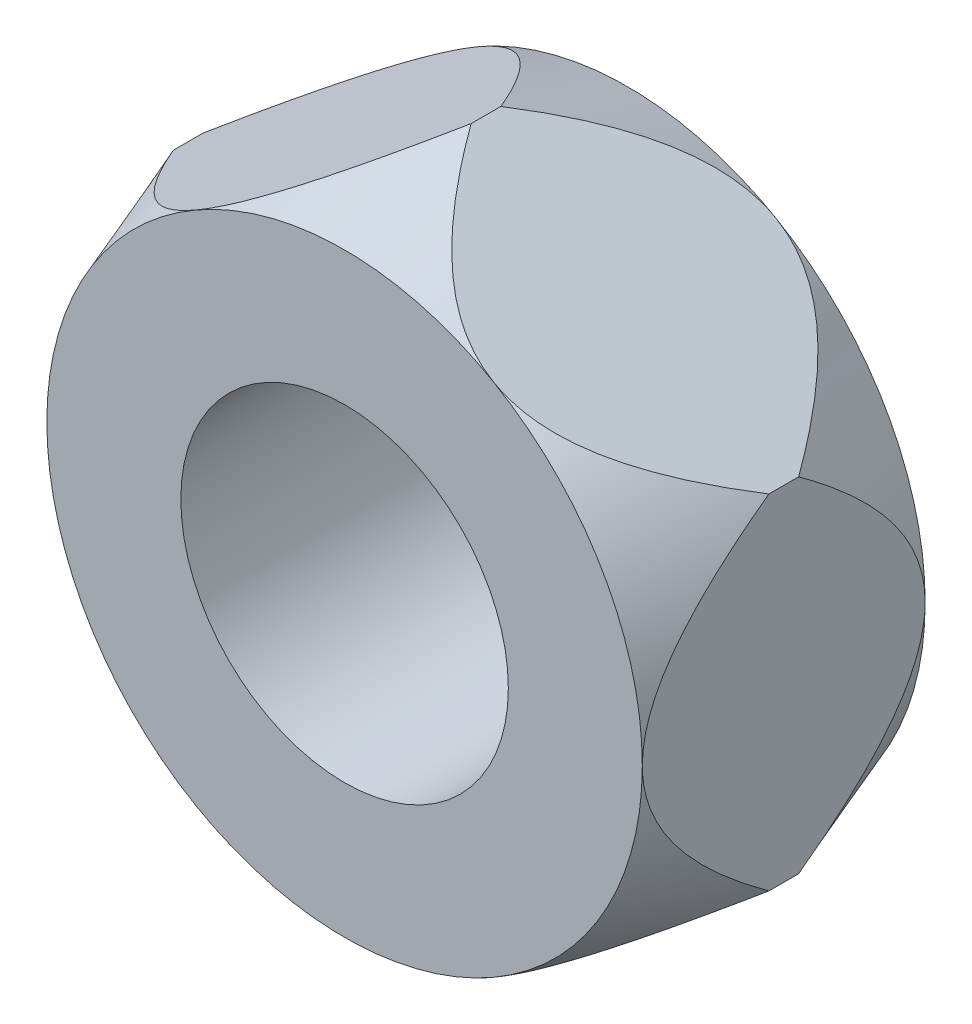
ISO-10303-21;
HEADER;
FILE_DESCRIPTION(('STEP AP214'),'2;1');
FILE_NAME('part.step','',(''),(''),'','','');
FILE_SCHEMA(('AUTOMOTIVE_DESIGN { 1 0 10303 214 1 1 1 1 }'));
ENDSEC;
DATA;
#1=APPLICATION_CONTEXT('core data for automotive mechanical design processes');
#2=APPLICATION_PROTOCOL_DEFINITION('international standard','automotive_design',2000,#1);
#3=PRODUCT_CONTEXT('',#1,'mechanical');
#4=PRODUCT('Part','Part','',(#3));
#5=PRODUCT_RELATED_PRODUCT_CATEGORY('part','',(#4));
#6=PRODUCT_DEFINITION_FORMATION('','',#4);
#7=PRODUCT_DEFINITION_CONTEXT('part definition',#1,'design');
#8=PRODUCT_DEFINITION('design','',#6,#7);
#9=PRODUCT_DEFINITION_SHAPE('','',#8);
#10=(LENGTH_UNIT() NAMED_UNIT(*) SI_UNIT(.MILLI.,.METRE.));
#11=(NAMED_UNIT(*) PLANE_ANGLE_UNIT() SI_UNIT($,.RADIAN.));
#12=(NAMED_UNIT(*) SI_UNIT($,.STERADIAN.) SOLID_ANGLE_UNIT());
#13=UNCERTAINTY_MEASURE_WITH_UNIT(LENGTH_MEASURE(1.E-05),#10,'distance_accuracy_value','');
#14=(GEOMETRIC_REPRESENTATION_CONTEXT(3) GLOBAL_UNCERTAINTY_ASSIGNED_CONTEXT((#13)) GLOBAL_UNIT_ASSIGNED_CONTEXT((#10,
#11,#12)) REPRESENTATION_CONTEXT('',''));
#15=CARTESIAN_POINT('',(0.,0.,0.));
#16=DIRECTION('',(0.,0.,1.));
#17=DIRECTION('',(1.,0.,0.));
#18=AXIS2_PLACEMENT_3D('',#15,#16,#17);
#19=CARTESIAN_POINT('',(5.,2.88675134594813,4.75));
#20=DIRECTION('',(-0.5,-0.866025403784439,0.));
#21=DIRECTION('',(0.866025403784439,-0.5,0.));
#22=AXIS2_PLACEMENT_3D('',#19,#20,#21);
#23=PLANE('',#22);
#24=CARTESIAN_POINT('',(-0.000199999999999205,5.7736181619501,2.12549844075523));
#25=CARTESIAN_POINT('',(0.0448790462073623,5.74759176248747,2.05399586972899));
#26=CARTESIAN_POINT('',(0.0905472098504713,5.72122523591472,1.98299032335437));
#27=CARTESIAN_POINT('',(0.183229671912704,5.66771499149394,1.84213123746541));
#28=CARTESIAN_POINT('',(0.230244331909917,5.64057106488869,1.7722780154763));
#29=CARTESIAN_POINT('',(0.374195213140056,5.55746098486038,1.56376798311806));
#30=CARTESIAN_POINT('',(0.473408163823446,5.50018036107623,1.42717266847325));
#31=CARTESIAN_POINT('',(0.683416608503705,5.37893192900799,1.15667511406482));
#32=CARTESIAN_POINT('',(0.794511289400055,5.31479138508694,1.02308009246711));
#33=CARTESIAN_POINT('',(1.02703794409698,5.18054205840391,0.768915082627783));
#34=CARTESIAN_POINT('',(1.14843509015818,5.11045338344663,0.648304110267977));
#35=CARTESIAN_POINT('',(1.32372033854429,5.00925239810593,0.497123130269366));
#36=CARTESIAN_POINT('',(1.37190575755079,4.98143253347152,0.457734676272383));
#37=CARTESIAN_POINT('',(1.47021651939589,4.92467278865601,0.382319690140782));
#38=CARTESIAN_POINT('',(1.52034228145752,4.89573266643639,0.346293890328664));
#39=CARTESIAN_POINT('',(1.67314153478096,4.80751397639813,0.244666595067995));
#40=CARTESIAN_POINT('',(1.77889727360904,4.74645587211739,0.184925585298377));
#41=CARTESIAN_POINT('',(1.97713874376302,4.63200110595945,0.0969868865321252));
#42=CARTESIAN_POINT('',(2.06832790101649,4.57935302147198,0.0649525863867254));
#43=CARTESIAN_POINT('',(2.25412565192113,4.47208263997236,0.0190046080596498));
#44=CARTESIAN_POINT('',(2.34873161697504,4.41746186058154,0.0050772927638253));
#45=CARTESIAN_POINT('',(2.53893961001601,4.30764522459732,-0.00276626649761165));
#46=CARTESIAN_POINT('',(2.63454402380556,4.2524479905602,0.0033914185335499));
#47=CARTESIAN_POINT('',(2.82324643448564,4.14350060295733,0.034968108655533));
#48=CARTESIAN_POINT('',(2.91634386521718,4.08975077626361,0.0603914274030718));
#49=CARTESIAN_POINT('',(3.12650018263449,3.96841696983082,0.137940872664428));
#50=CARTESIAN_POINT('',(3.24191214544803,3.90178384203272,0.19594248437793));
#51=CARTESIAN_POINT('',(3.40841134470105,3.80565548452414,0.297959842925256));
#52=CARTESIAN_POINT('',(3.46307182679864,3.77409724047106,0.334696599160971));
#53=CARTESIAN_POINT('',(3.57012380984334,3.71229074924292,0.412331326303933));
#54=CARTESIAN_POINT('',(3.62251592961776,3.68204214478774,0.45322815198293));
#55=CARTESIAN_POINT('',(3.80863269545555,3.57458757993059,0.607675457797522));
#56=CARTESIAN_POINT('',(3.93610886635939,3.500989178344,0.731250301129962));
#57=CARTESIAN_POINT('',(4.17976162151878,3.36031619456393,0.992935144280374));
#58=CARTESIAN_POINT('',(4.29589288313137,3.29326777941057,1.13109919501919));
#59=CARTESIAN_POINT('',(4.51370525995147,3.16751374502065,1.40969560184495));
#60=CARTESIAN_POINT('',(4.6158157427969,3.10856023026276,1.54968434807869));
#61=CARTESIAN_POINT('',(4.76377257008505,3.0231373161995,1.76344181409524));
#62=CARTESIAN_POINT('',(4.81203428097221,2.99527340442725,1.83501952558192));
#63=CARTESIAN_POINT('',(4.90713666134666,2.94036601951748,1.97939050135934));
#64=CARTESIAN_POINT('',(4.95397774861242,2.91332230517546,2.05218339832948));
#65=CARTESIAN_POINT('',(5.00020000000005,2.88663587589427,2.12549844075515));
#66=B_SPLINE_CURVE_WITH_KNOTS('',3,(#24,#25,#26,#27,#28,#29,#30,#31,#32,#33,#34,#35,#36,#37,#38,
#39,#40,#41,#42,#43,#44,#45,#46,#47,#48,#49,#50,#51,#52,#53,#54,#55,#56,#57,#58,#59,#60,#61,#62,
#63,#64,#65),.UNSPECIFIED.,.F.,.F.,(4,2,2,2,2,2,2,2,2,2,2,2,2,2,2,2,2,2,2,2,4),(0.,
0.265318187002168,0.530708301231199,1.06522413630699,1.62036194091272,2.17369263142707,
2.3780959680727,2.58254371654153,2.98856700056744,3.31744445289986,3.64607407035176,
3.97591467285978,4.30582914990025,4.73925818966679,4.95823818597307,5.17715806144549,
5.75198484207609,6.32902141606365,6.87775652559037,7.1498813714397,7.42192539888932),.UNSPECIFIED.);
#67=CARTESIAN_POINT('',(0.,5.77350269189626,2.12518117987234));
#68=VERTEX_POINT('',#67);
#69=CARTESIAN_POINT('',(2.5,4.3301270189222,0.));
#70=VERTEX_POINT('',#69);
#71=EDGE_CURVE('E48',#68,#70,#66,.T.);
#72=ORIENTED_EDGE('',*,*,#71,.F.);
#73=DIRECTION('',(0.,0.,-1.));
#74=VECTOR('',#73,1.);
#75=CARTESIAN_POINT('',(0.,5.77350269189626,4.75));
#76=LINE('',#75,#74);
#77=CARTESIAN_POINT('',(0.,5.77350269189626,2.62481882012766));
#78=VERTEX_POINT('',#77);
#79=EDGE_CURVE('E165',#78,#68,#76,.T.);
#80=ORIENTED_EDGE('',*,*,#79,.F.);
#81=CARTESIAN_POINT('',(5.0002,2.88663587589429,2.62450155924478));
#82=CARTESIAN_POINT('',(4.95512095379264,2.91266227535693,2.69600413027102));
#83=CARTESIAN_POINT('',(4.90945279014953,2.93902880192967,2.76700967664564));
#84=CARTESIAN_POINT('',(4.8167703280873,2.99253904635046,2.9078687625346));
#85=CARTESIAN_POINT('',(4.76975566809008,3.01968297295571,2.97772198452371));
#86=CARTESIAN_POINT('',(4.62580478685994,3.10279305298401,3.18623201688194));
#87=CARTESIAN_POINT('',(4.52659183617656,3.16007367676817,3.32282733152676));
#88=CARTESIAN_POINT('',(4.31658339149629,3.28132210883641,3.59332488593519));
#89=CARTESIAN_POINT('',(4.20548871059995,3.34546265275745,3.7269199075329));
#90=CARTESIAN_POINT('',(3.97296205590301,3.47971197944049,3.98108491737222));
#91=CARTESIAN_POINT('',(3.85156490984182,3.54980065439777,4.10169588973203));
#92=CARTESIAN_POINT('',(3.6762796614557,3.65100163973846,4.25287686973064));
#93=CARTESIAN_POINT('',(3.62809424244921,3.67882150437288,4.29226532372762));
#94=CARTESIAN_POINT('',(3.52978348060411,3.73558124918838,4.36768030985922));
#95=CARTESIAN_POINT('',(3.47965771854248,3.764521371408,4.40370610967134));
#96=CARTESIAN_POINT('',(3.32685846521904,3.85274006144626,4.50533340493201));
#97=CARTESIAN_POINT('',(3.22110272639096,3.913798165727,4.56507441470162));
#98=CARTESIAN_POINT('',(3.02286125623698,4.02825293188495,4.65301311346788));
#99=CARTESIAN_POINT('',(2.93167209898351,4.08090101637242,4.68504741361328));
#100=CARTESIAN_POINT('',(2.74587434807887,4.18817139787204,4.73099539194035));
#101=CARTESIAN_POINT('',(2.65126838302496,4.24279217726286,4.74492270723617));
#102=CARTESIAN_POINT('',(2.46106038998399,4.35260881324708,4.75276626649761));
#103=CARTESIAN_POINT('',(2.36545597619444,4.40780604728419,4.74660858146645));
#104=CARTESIAN_POINT('',(2.17675356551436,4.51675343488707,4.71503189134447));
#105=CARTESIAN_POINT('',(2.08365613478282,4.57050326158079,4.68960857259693));
#106=CARTESIAN_POINT('',(1.87349981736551,4.69183706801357,4.61205912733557));
#107=CARTESIAN_POINT('',(1.75808785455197,4.75847019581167,4.55405751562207));
#108=CARTESIAN_POINT('',(1.59158865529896,4.85459855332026,4.45204015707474));
#109=CARTESIAN_POINT('',(1.53692817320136,4.88615679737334,4.41530340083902));
#110=CARTESIAN_POINT('',(1.42987619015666,4.94796328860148,4.33766867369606));
#111=CARTESIAN_POINT('',(1.37748407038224,4.97821189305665,4.29677184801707));
#112=CARTESIAN_POINT('',(1.19136730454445,5.0856664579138,4.14232454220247));
#113=CARTESIAN_POINT('',(1.06389113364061,5.1592648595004,4.01874969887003));
#114=CARTESIAN_POINT('',(0.820238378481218,5.29993784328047,3.75706485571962));
#115=CARTESIAN_POINT('',(0.704107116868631,5.36698625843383,3.6189008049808));
#116=CARTESIAN_POINT('',(0.486294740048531,5.49274029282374,3.34030439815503));
#117=CARTESIAN_POINT('',(0.384184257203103,5.55169380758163,3.2003156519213));
#118=CARTESIAN_POINT('',(0.236227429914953,5.63711672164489,2.98655818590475));
#119=CARTESIAN_POINT('',(0.187965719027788,5.66498063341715,2.91498047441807));
#120=CARTESIAN_POINT('',(0.0928633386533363,5.71988801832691,2.77060949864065));
#121=CARTESIAN_POINT('',(0.0460222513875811,5.74693173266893,2.69781660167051));
#122=CARTESIAN_POINT('',(-0.000200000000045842,5.77361816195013,2.62450155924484));
#123=B_SPLINE_CURVE_WITH_KNOTS('',3,(#81,#82,#83,#84,#85,#86,#87,#88,#89,#90,#91,#92,#93,#94,
#95,#96,#97,#98,#99,#100,#101,#102,#103,#104,#105,#106,#107,#108,#109,#110,#111,#112,#113,#114,
#115,#116,#117,#118,#119,#120,#121,#122),.UNSPECIFIED.,.F.,.F.,(4,2,2,2,2,2,2,2,2,2,2,2,2,2,2,2,
2,2,2,2,4),(0.,0.265318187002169,0.530708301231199,1.06522413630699,1.62036194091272,
2.17369263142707,2.3780959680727,2.58254371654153,2.98856700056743,3.31744445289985,
3.64607407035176,3.97591467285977,4.30582914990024,4.73925818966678,4.95823818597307,
5.17715806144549,5.75198484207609,6.32902141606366,6.87775652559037,7.1498813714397,
7.42192539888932),.UNSPECIFIED.);
#124=CARTESIAN_POINT('',(2.5,4.3301270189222,4.75));
#125=VERTEX_POINT('',#124);
#126=EDGE_CURVE('E235',#125,#78,#123,.T.);
#127=ORIENTED_EDGE('',*,*,#126,.F.);
#128=CARTESIAN_POINT('',(5.,2.88675134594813,2.62481882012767));
#129=VERTEX_POINT('',#128);
#130=EDGE_CURVE('E156',#129,#125,#123,.T.);
#131=ORIENTED_EDGE('',*,*,#130,.F.);
#132=DIRECTION('',(0.,0.,-1.));
#133=VECTOR('',#132,1.);
#134=CARTESIAN_POINT('',(5.,2.88675134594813,4.75));
#135=LINE('',#134,#133);
#136=CARTESIAN_POINT('',(5.,2.88675134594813,2.12518117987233));
#137=VERTEX_POINT('',#136);
#138=EDGE_CURVE('E151',#129,#137,#135,.T.);
#139=ORIENTED_EDGE('',*,*,#138,.T.);
#140=EDGE_CURVE('E143',#70,#137,#66,.T.);
#141=ORIENTED_EDGE('',*,*,#140,.F.);
#142=EDGE_LOOP('',(#72,#80,#127,#131,#139,#141));
#143=FACE_BOUND('',#142,.T.);
#144=ADVANCED_FACE('F32',(#143),#23,.F.);
#145=CARTESIAN_POINT('',(0.,5.77350269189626,4.75));
#146=DIRECTION('',(0.5,-0.866025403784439,0.));
#147=DIRECTION('',(0.866025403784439,0.5,0.));
#148=AXIS2_PLACEMENT_3D('',#145,#146,#147);
#149=PLANE('',#148);
#150=CARTESIAN_POINT('',(-5.0002,2.88663587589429,2.12549844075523));
#151=CARTESIAN_POINT('',(-4.95512095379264,2.91266227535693,2.05399586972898));
#152=CARTESIAN_POINT('',(-4.90945279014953,2.93902880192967,1.98299032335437));
#153=CARTESIAN_POINT('',(-4.8167703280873,2.99253904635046,1.84213123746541));
#154=CARTESIAN_POINT('',(-4.76975566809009,3.01968297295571,1.7722780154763));
#155=CARTESIAN_POINT('',(-4.62580478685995,3.10279305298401,1.56376798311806));
#156=CARTESIAN_POINT('',(-4.52659183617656,3.16007367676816,1.42717266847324));
#157=CARTESIAN_POINT('',(-4.3165833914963,3.28132210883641,1.15667511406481));
#158=CARTESIAN_POINT('',(-4.20548871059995,3.34546265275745,1.02308009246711));
#159=CARTESIAN_POINT('',(-3.97296205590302,3.47971197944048,0.768915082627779));
#160=CARTESIAN_POINT('',(-3.85156490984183,3.54980065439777,0.648304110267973));
#161=CARTESIAN_POINT('',(-3.67627966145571,3.65100163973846,0.497123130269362));
#162=CARTESIAN_POINT('',(-3.62809424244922,3.67882150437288,0.457734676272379));
#163=CARTESIAN_POINT('',(-3.52978348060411,3.73558124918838,0.382319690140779));
#164=CARTESIAN_POINT('',(-3.47965771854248,3.764521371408,0.346293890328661));
#165=CARTESIAN_POINT('',(-3.32685846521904,3.85274006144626,0.244666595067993));
#166=CARTESIAN_POINT('',(-3.22110272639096,3.913798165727,0.184925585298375));
#167=CARTESIAN_POINT('',(-3.02286125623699,4.02825293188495,0.0969868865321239));
#168=CARTESIAN_POINT('',(-2.93167209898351,4.08090101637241,0.0649525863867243));
#169=CARTESIAN_POINT('',(-2.74587434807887,4.18817139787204,0.0190046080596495));
#170=CARTESIAN_POINT('',(-2.65126838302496,4.24279217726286,0.00507729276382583));
#171=CARTESIAN_POINT('',(-2.461060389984,4.35260881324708,-0.00276626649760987));
#172=CARTESIAN_POINT('',(-2.36545597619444,4.40780604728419,0.00339141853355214));
#173=CARTESIAN_POINT('',(-2.17675356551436,4.51675343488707,0.0349681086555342));
#174=CARTESIAN_POINT('',(-2.08365613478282,4.57050326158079,0.0603914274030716));
#175=CARTESIAN_POINT('',(-1.87349981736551,4.69183706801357,0.137940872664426));
#176=CARTESIAN_POINT('',(-1.75808785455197,4.75847019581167,0.195942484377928));
#177=CARTESIAN_POINT('',(-1.59158865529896,4.85459855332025,0.297959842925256));
#178=CARTESIAN_POINT('',(-1.53692817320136,4.88615679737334,0.334696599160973));
#179=CARTESIAN_POINT('',(-1.42987619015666,4.94796328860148,0.412331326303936));
#180=CARTESIAN_POINT('',(-1.37748407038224,4.97821189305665,0.453228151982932));
#181=CARTESIAN_POINT('',(-1.19136730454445,5.0856664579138,0.607675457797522));
#182=CARTESIAN_POINT('',(-1.06389113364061,5.1592648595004,0.731250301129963));
#183=CARTESIAN_POINT('',(-0.82023837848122,5.29993784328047,0.992935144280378));
#184=CARTESIAN_POINT('',(-0.704107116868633,5.36698625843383,1.13109919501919));
#185=CARTESIAN_POINT('',(-0.486294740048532,5.49274029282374,1.40969560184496));
#186=CARTESIAN_POINT('',(-0.384184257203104,5.55169380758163,1.54968434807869));
#187=CARTESIAN_POINT('',(-0.236227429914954,5.63711672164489,1.76344181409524));
#188=CARTESIAN_POINT('',(-0.187965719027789,5.66498063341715,1.83501952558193));
#189=CARTESIAN_POINT('',(-0.0928633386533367,5.71988801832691,1.97939050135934));
#190=CARTESIAN_POINT('',(-0.0460222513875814,5.74693173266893,2.05218339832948));
#191=CARTESIAN_POINT('',(0.000200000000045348,5.77361816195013,2.12549844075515));
#192=B_SPLINE_CURVE_WITH_KNOTS('',3,(#150,#151,#152,#153,#154,#155,#156,#157,#158,#159,#160,
#161,#162,#163,#164,#165,#166,#167,#168,#169,#170,#171,#172,#173,#174,#175,#176,#177,#178,#179,
#180,#181,#182,#183,#184,#185,#186,#187,#188,#189,#190,#191),.UNSPECIFIED.,.F.,.F.,(4,2,2,2,2,2,
2,2,2,2,2,2,2,2,2,2,2,2,2,2,4),(0.,0.265318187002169,0.530708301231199,1.06522413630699,
1.62036194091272,2.17369263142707,2.3780959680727,2.58254371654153,2.98856700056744,
3.31744445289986,3.64607407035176,3.97591467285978,4.30582914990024,4.73925818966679,
4.95823818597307,5.1771580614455,5.75198484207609,6.32902141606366,6.87775652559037,
7.14988137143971,7.42192539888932),.UNSPECIFIED.);
#193=CARTESIAN_POINT('',(-5.,2.88675134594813,2.12518117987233));
#194=VERTEX_POINT('',#193);
#195=CARTESIAN_POINT('',(-2.5,4.3301270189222,0.));
#196=VERTEX_POINT('',#195);
#197=EDGE_CURVE('E55',#194,#196,#192,.T.);
#198=ORIENTED_EDGE('',*,*,#197,.F.);
#199=DIRECTION('',(0.,0.,-1.));
#200=VECTOR('',#199,1.);
#201=CARTESIAN_POINT('',(-5.,2.88675134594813,4.75));
#202=LINE('',#201,#200);
#203=CARTESIAN_POINT('',(-5.,2.88675134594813,2.62481882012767));
#204=VERTEX_POINT('',#203);
#205=EDGE_CURVE('E162',#204,#194,#202,.T.);
#206=ORIENTED_EDGE('',*,*,#205,.F.);
#207=CARTESIAN_POINT('',(0.000200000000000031,5.7736181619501,2.62450155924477));
#208=CARTESIAN_POINT('',(-0.0448790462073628,5.74759176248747,2.69600413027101));
#209=CARTESIAN_POINT('',(-0.090547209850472,5.72122523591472,2.76700967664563));
#210=CARTESIAN_POINT('',(-0.183229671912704,5.66771499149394,2.90786876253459));
#211=CARTESIAN_POINT('',(-0.230244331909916,5.64057106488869,2.9777219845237));
#212=CARTESIAN_POINT('',(-0.374195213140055,5.55746098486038,3.18623201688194));
#213=CARTESIAN_POINT('',(-0.473408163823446,5.50018036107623,3.32282733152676));
#214=CARTESIAN_POINT('',(-0.683416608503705,5.37893192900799,3.59332488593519));
#215=CARTESIAN_POINT('',(-0.794511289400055,5.31479138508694,3.72691990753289));
#216=CARTESIAN_POINT('',(-1.02703794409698,5.18054205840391,3.98108491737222));
#217=CARTESIAN_POINT('',(-1.14843509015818,5.11045338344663,4.10169588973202));
#218=CARTESIAN_POINT('',(-1.3237203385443,5.00925239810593,4.25287686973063));
#219=CARTESIAN_POINT('',(-1.37190575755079,4.98143253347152,4.29226532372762));
#220=CARTESIAN_POINT('',(-1.47021651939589,4.92467278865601,4.36768030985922));
#221=CARTESIAN_POINT('',(-1.52034228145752,4.89573266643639,4.40370610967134));
#222=CARTESIAN_POINT('',(-1.67314153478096,4.80751397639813,4.50533340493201));
#223=CARTESIAN_POINT('',(-1.77889727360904,4.74645587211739,4.56507441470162));
#224=CARTESIAN_POINT('',(-1.97713874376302,4.63200110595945,4.65301311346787));
#225=CARTESIAN_POINT('',(-2.06832790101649,4.57935302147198,4.68504741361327));
#226=CARTESIAN_POINT('',(-2.25412565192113,4.47208263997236,4.73099539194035));
#227=CARTESIAN_POINT('',(-2.34873161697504,4.41746186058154,4.74492270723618));
#228=CARTESIAN_POINT('',(-2.53893961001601,4.30764522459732,4.75276626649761));
#229=CARTESIAN_POINT('',(-2.63454402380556,4.2524479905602,4.74660858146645));
#230=CARTESIAN_POINT('',(-2.82324643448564,4.14350060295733,4.71503189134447));
#231=CARTESIAN_POINT('',(-2.91634386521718,4.08975077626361,4.68960857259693));
#232=CARTESIAN_POINT('',(-3.12650018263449,3.96841696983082,4.61205912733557));
#233=CARTESIAN_POINT('',(-3.24191214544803,3.90178384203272,4.55405751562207));
#234=CARTESIAN_POINT('',(-3.40841134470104,3.80565548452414,4.45204015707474));
#235=CARTESIAN_POINT('',(-3.46307182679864,3.77409724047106,4.41530340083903));
#236=CARTESIAN_POINT('',(-3.57012380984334,3.71229074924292,4.33766867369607));
#237=CARTESIAN_POINT('',(-3.62251592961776,3.68204214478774,4.29677184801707));
#238=CARTESIAN_POINT('',(-3.80863269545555,3.57458757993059,4.14232454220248));
#239=CARTESIAN_POINT('',(-3.93610886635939,3.50098917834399,4.01874969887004));
#240=CARTESIAN_POINT('',(-4.17976162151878,3.36031619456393,3.75706485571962));
#241=CARTESIAN_POINT('',(-4.29589288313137,3.29326777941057,3.61890080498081));
#242=CARTESIAN_POINT('',(-4.51370525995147,3.16751374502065,3.34030439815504));
#243=CARTESIAN_POINT('',(-4.6158157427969,3.10856023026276,3.20031565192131));
#244=CARTESIAN_POINT('',(-4.76377257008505,3.0231373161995,2.98655818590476));
#245=CARTESIAN_POINT('',(-4.81203428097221,2.99527340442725,2.91498047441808));
#246=CARTESIAN_POINT('',(-4.90713666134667,2.94036601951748,2.77060949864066));
#247=CARTESIAN_POINT('',(-4.95397774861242,2.91332230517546,2.69781660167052));
#248=CARTESIAN_POINT('',(-5.00020000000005,2.88663587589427,2.62450155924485));
#249=B_SPLINE_CURVE_WITH_KNOTS('',3,(#207,#208,#209,#210,#211,#212,#213,#214,#215,#216,#217,
#218,#219,#220,#221,#222,#223,#224,#225,#226,#227,#228,#229,#230,#231,#232,#233,#234,#235,#236,
#237,#238,#239,#240,#241,#242,#243,#244,#245,#246,#247,#248),.UNSPECIFIED.,.F.,.F.,(4,2,2,2,2,2,
2,2,2,2,2,2,2,2,2,2,2,2,2,2,4),(0.,0.265318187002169,0.530708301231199,1.06522413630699,
1.62036194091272,2.17369263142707,2.3780959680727,2.58254371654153,2.98856700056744,
3.31744445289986,3.64607407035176,3.97591467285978,4.30582914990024,4.73925818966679,
4.95823818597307,5.17715806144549,5.75198484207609,6.32902141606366,6.87775652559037,
7.14988137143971,7.42192539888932),.UNSPECIFIED.);
#250=CARTESIAN_POINT('',(-2.5,4.3301270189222,4.75));
#251=VERTEX_POINT('',#250);
#252=EDGE_CURVE('E289',#251,#204,#249,.T.);
#253=ORIENTED_EDGE('',*,*,#252,.F.);
#254=EDGE_CURVE('E293',#78,#251,#249,.T.);
#255=ORIENTED_EDGE('',*,*,#254,.F.);
#256=ORIENTED_EDGE('',*,*,#79,.T.);
#257=EDGE_CURVE('E273',#196,#68,#192,.T.);
#258=ORIENTED_EDGE('',*,*,#257,.F.);
#259=EDGE_LOOP('',(#198,#206,#253,#255,#256,#258));
#260=FACE_BOUND('',#259,.T.);
#261=ADVANCED_FACE('F282',(#260),#149,.F.);
#262=CARTESIAN_POINT('',(-5.,2.88675134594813,4.75));
#263=DIRECTION('',(1.,0.,0.));
#264=DIRECTION('',(0.,1.,0.));
#265=AXIS2_PLACEMENT_3D('',#262,#263,#264);
#266=PLANE('',#265);
#267=CARTESIAN_POINT('',(-5.00000000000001,-9.98767880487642,16.9500696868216));
#268=CARTESIAN_POINT('',(-5.00000000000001,-9.77408297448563,16.4253859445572));
#269=CARTESIAN_POINT('',(-5.00000000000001,-9.55936238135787,15.901156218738));
#270=CARTESIAN_POINT('',(-5.00000000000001,-9.12703579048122,14.8538364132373));
#271=CARTESIAN_POINT('',(-5.00000000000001,-8.90942954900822,14.3307464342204));
#272=CARTESIAN_POINT('',(-5.00000000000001,-8.4698603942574,13.2839516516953));
#273=CARTESIAN_POINT('',(-5.00000000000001,-8.24788360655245,12.7602526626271));
#274=CARTESIAN_POINT('',(-5.00000000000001,-7.79952660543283,11.7147782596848));
#275=CARTESIAN_POINT('',(-5.00000000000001,-7.57314665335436,11.1930027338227));
#276=CARTESIAN_POINT('',(-5.00000000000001,-7.08933266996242,10.0941866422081));
#277=CARTESIAN_POINT('',(-5.00000000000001,-6.83123910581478,9.51743490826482));
#278=CARTESIAN_POINT('',(-5.00000000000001,-6.43695611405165,8.65550167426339));
#279=CARTESIAN_POINT('',(-5.00000000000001,-6.30432365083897,8.36869292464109));
#280=CARTESIAN_POINT('',(-5.00000000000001,-6.03622699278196,7.79640338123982));
#281=CARTESIAN_POINT('',(-5.00000000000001,-5.9007628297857,7.51092257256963));
#282=CARTESIAN_POINT('',(-5.00000000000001,-5.62672973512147,6.94220260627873));
#283=CARTESIAN_POINT('',(-5.00000000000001,-5.4881680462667,6.65895996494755));
#284=CARTESIAN_POINT('',(-5.00000000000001,-5.20692369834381,6.09453218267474));
#285=CARTESIAN_POINT('',(-5.00000000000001,-5.06424115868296,5.81334698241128));
#286=CARTESIAN_POINT('',(-5.00000000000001,-4.77380264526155,5.25371944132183));
#287=CARTESIAN_POINT('',(-5.00000000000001,-4.62604834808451,4.97527623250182));
#288=CARTESIAN_POINT('',(-5.00000000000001,-4.32406707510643,4.42193245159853));
#289=CARTESIAN_POINT('',(-5.00000000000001,-4.16984077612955,4.14703151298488));
#290=CARTESIAN_POINT('',(-5.00000000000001,-3.93331952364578,3.7403970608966));
#291=CARTESIAN_POINT('',(-5.00000000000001,-3.85423355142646,3.60679599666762));
#292=CARTESIAN_POINT('',(-5.00000000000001,-3.693670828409,3.34102830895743));
#293=CARTESIAN_POINT('',(-5.00000000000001,-3.61219399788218,3.20886173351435));
#294=CARTESIAN_POINT('',(-5.00000000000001,-3.4463402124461,2.94608310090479));
#295=CARTESIAN_POINT('',(-5.00000000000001,-3.36195914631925,2.81547363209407));
#296=CARTESIAN_POINT('',(-5.00000000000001,-3.18992131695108,2.55643220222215));
#297=CARTESIAN_POINT('',(-5.00000000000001,-3.1022647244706,2.42800012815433));
#298=CARTESIAN_POINT('',(-5.00000000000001,-2.92435189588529,2.17572849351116));
#299=CARTESIAN_POINT('',(-5.00000000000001,-2.83415208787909,2.05184929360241));
#300=CARTESIAN_POINT('',(-5.00000000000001,-2.64920661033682,1.80753711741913));
#301=CARTESIAN_POINT('',(-5.00000000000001,-2.55446156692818,1.68710367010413));
#302=CARTESIAN_POINT('',(-5.00000000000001,-2.35963870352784,1.45103552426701));
#303=CARTESIAN_POINT('',(-5.00000000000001,-2.25957269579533,1.33539113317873));
#304=CARTESIAN_POINT('',(-5.00000000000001,-2.05271056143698,1.1103288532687));
#305=CARTESIAN_POINT('',(-5.00000000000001,-1.94591890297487,1.00090692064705));
#306=CARTESIAN_POINT('',(-5.00000000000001,-1.7783393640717,0.842293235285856));
#307=CARTESIAN_POINT('',(-5.00000000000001,-1.72063502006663,0.789848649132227));
#308=CARTESIAN_POINT('',(-5.00000000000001,-1.60280666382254,0.687749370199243));
#309=CARTESIAN_POINT('',(-5.00000000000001,-1.54268229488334,0.638095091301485));
#310=CARTESIAN_POINT('',(-5.00000000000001,-1.35829535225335,0.494184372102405));
#311=CARTESIAN_POINT('',(-5.00000000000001,-1.2299600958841,0.404922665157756));
#312=CARTESIAN_POINT('',(-5.00000000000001,-0.985563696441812,0.26122715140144));
#313=CARTESIAN_POINT('',(-5.00000000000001,-0.871525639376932,0.203410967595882));
#314=CARTESIAN_POINT('',(-5.00000000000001,-0.635590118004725,0.106867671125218));
#315=CARTESIAN_POINT('',(-5.00000000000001,-0.513709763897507,0.0681004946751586));
#316=CARTESIAN_POINT('',(-5.00000000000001,-0.286578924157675,0.0196762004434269));
#317=CARTESIAN_POINT('',(-5.00000000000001,-0.182179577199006,0.00609501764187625));
#318=CARTESIAN_POINT('',(-5.00000000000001,0.0273998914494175,-0.00280418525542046));
#319=CARTESIAN_POINT('',(-5.,0.132579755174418,0.00187200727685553));
#320=CARTESIAN_POINT('',(-5.,0.340251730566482,0.0288234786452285));
#321=CARTESIAN_POINT('',(-5.,0.44275115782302,0.051044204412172));
#322=CARTESIAN_POINT('',(-5.,0.643213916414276,0.110488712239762));
#323=CARTESIAN_POINT('',(-5.,0.741174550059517,0.147721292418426));
#324=CARTESIAN_POINT('',(-5.,0.997188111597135,0.263747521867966));
#325=CARTESIAN_POINT('',(-5.,1.15023937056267,0.353514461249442));
#326=CARTESIAN_POINT('',(-5.,1.36859811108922,0.504002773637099));
#327=CARTESIAN_POINT('',(-5.,1.43967777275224,0.55695717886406));
#328=CARTESIAN_POINT('',(-5.,1.57845915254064,0.667133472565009));
#329=CARTESIAN_POINT('',(-5.,1.64616177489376,0.724354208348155));
#330=CARTESIAN_POINT('',(-5.,1.80993410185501,0.870130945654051));
#331=CARTESIAN_POINT('',(-5.,1.90422221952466,0.960673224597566));
#332=CARTESIAN_POINT('',(-5.,2.08732237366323,1.14717006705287));
#333=CARTESIAN_POINT('',(-5.,2.17613151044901,1.24312744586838));
#334=CARTESIAN_POINT('',(-5.,2.34929719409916,1.43927771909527));
#335=CARTESIAN_POINT('',(-5.,2.43364500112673,1.53947828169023));
#336=CARTESIAN_POINT('',(-5.,2.59845907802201,1.74302666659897));
#337=CARTESIAN_POINT('',(-5.,2.67892485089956,1.84637488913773));
#338=CARTESIAN_POINT('',(-5.,2.83749806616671,2.0567897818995));
#339=CARTESIAN_POINT('',(-5.,2.91556606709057,2.16388606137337));
#340=CARTESIAN_POINT('',(-5.,3.06882669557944,2.38011633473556));
#341=CARTESIAN_POINT('',(-5.,3.14401920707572,2.48925041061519));
#342=CARTESIAN_POINT('',(-5.,3.29183070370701,2.70903463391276));
#343=CARTESIAN_POINT('',(-5.,3.36445295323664,2.81968259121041));
#344=CARTESIAN_POINT('',(-5.,3.50754703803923,3.04235050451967));
#345=CARTESIAN_POINT('',(-5.,3.57801895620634,3.15437040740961));
#346=CARTESIAN_POINT('',(-5.,3.81078415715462,3.53124824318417));
#347=CARTESIAN_POINT('',(-5.,3.96887834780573,3.79870236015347));
#348=CARTESIAN_POINT('',(-5.,4.27739712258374,4.33801316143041));
#349=CARTESIAN_POINT('',(-5.,4.42782041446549,4.60987057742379));
#350=CARTESIAN_POINT('',(-5.,4.72277116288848,5.15693544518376));
#351=CARTESIAN_POINT('',(-5.,4.86729556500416,5.43214453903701));
#352=CARTESIAN_POINT('',(-5.,5.1515991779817,5.98500482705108));
#353=CARTESIAN_POINT('',(-5.,5.29137823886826,6.26265609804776));
#354=CARTESIAN_POINT('',(-5.,5.56747369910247,6.82064724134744));
#355=CARTESIAN_POINT('',(-5.,5.70377920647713,7.10099249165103));
#356=CARTESIAN_POINT('',(-5.,5.97319209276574,7.66321690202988));
#357=CARTESIAN_POINT('',(-5.,6.10629942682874,7.94509608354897));
#358=CARTESIAN_POINT('',(-5.,6.50155107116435,8.79240904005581));
#359=CARTESIAN_POINT('',(-5.,6.75971400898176,9.35969998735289));
#360=CARTESIAN_POINT('',(-5.,7.24010400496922,10.4344838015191));
#361=CARTESIAN_POINT('',(-5.,7.46313716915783,10.9416186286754));
#362=CARTESIAN_POINT('',(-5.,7.90449079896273,11.9579886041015));
#363=CARTESIAN_POINT('',(-5.,8.1228108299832,12.4672239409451));
#364=CARTESIAN_POINT('',(-5.,8.55454561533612,13.4845507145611));
#365=CARTESIAN_POINT('',(-5.,8.76798037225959,13.9926336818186));
#366=CARTESIAN_POINT('',(-5.,9.19178338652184,15.0100038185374));
#367=CARTESIAN_POINT('',(-5.,9.40215202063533,15.519290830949));
#368=CARTESIAN_POINT('',(-5.,9.61133396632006,16.0290602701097));
#369=B_SPLINE_CURVE_WITH_KNOTS('',3,(#267,#268,#269,#270,#271,#272,#273,#274,#275,#276,#277,
#278,#279,#280,#281,#282,#283,#284,#285,#286,#287,#288,#289,#290,#291,#292,#293,#294,#295,#296,
#297,#298,#299,#300,#301,#302,#303,#304,#305,#306,#307,#308,#309,#310,#311,#312,#313,#314,#315,
#316,#317,#318,#319,#320,#321,#322,#323,#324,#325,#326,#327,#328,#329,#330,#331,#332,#333,#334,
#335,#336,#337,#338,#339,#340,#341,#342,#343,#344,#345,#346,#347,#348,#349,#350,#351,#352,#353,
#354,#355,#356,#357,#358,#359,#360,#361,#362,#363,#364,#365,#366,#367,#368),.UNSPECIFIED.,.F.,
.F.,(4,2,2,2,2,2,2,2,2,2,2,2,2,2,2,2,2,2,2,2,2,2,2,2,2,2,2,2,2,2,2,2,2,2,2,2,2,2,2,2,2,2,2,2,2,
2,2,2,2,2,4),(0.,1.69948794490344,3.39912035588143,5.10550555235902,6.81178977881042,
8.70731522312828,9.65527782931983,10.6032297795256,11.5491587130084,12.4950602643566,
13.4406520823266,14.3861452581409,14.8518879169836,15.31764612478,15.7840932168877,
16.2505160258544,16.7101482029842,17.1697172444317,17.62830551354,18.0865922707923,
18.3204380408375,18.5543184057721,19.0218335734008,19.404179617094,19.785718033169,
20.1000675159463,20.414317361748,20.7275939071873,21.0410543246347,21.570075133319,
21.8359145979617,22.1016824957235,22.4935461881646,22.8856155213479,23.2784264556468,
23.6712875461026,24.0688220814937,24.4663726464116,24.863398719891,25.2604094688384,
26.1922649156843,27.1242768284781,28.0567653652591,28.9892833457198,29.9244344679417,
30.859598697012,32.7293201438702,34.3913320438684,36.0534965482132,37.7067631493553,
39.3598248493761),.UNSPECIFIED.);
#370=CARTESIAN_POINT('',(-5.00000000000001,-2.88675134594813,2.12518117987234));
#371=VERTEX_POINT('',#370);
#372=CARTESIAN_POINT('',(-5.,0.,0.));
#373=VERTEX_POINT('',#372);
#374=EDGE_CURVE('E302',#371,#373,#369,.T.);
#375=ORIENTED_EDGE('',*,*,#374,.F.);
#376=DIRECTION('',(0.,0.,-1.));
#377=VECTOR('',#376,1.);
#378=CARTESIAN_POINT('',(-5.00000000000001,-2.88675134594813,4.75));
#379=LINE('',#378,#377);
#380=CARTESIAN_POINT('',(-5.00000000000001,-2.88675134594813,2.62481882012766));
#381=VERTEX_POINT('',#380);
#382=EDGE_CURVE('E153',#381,#371,#379,.T.);
#383=ORIENTED_EDGE('',*,*,#382,.F.);
#384=CARTESIAN_POINT('',(-5.00000000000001,-5.87629143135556,-2.71110623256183));
#385=CARTESIAN_POINT('',(-5.00000000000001,-5.75955859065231,-2.46690004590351));
#386=CARTESIAN_POINT('',(-5.00000000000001,-5.64167710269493,-2.2232349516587));
#387=CARTESIAN_POINT('',(-5.00000000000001,-5.40307148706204,-1.73723507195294));
#388=CARTESIAN_POINT('',(-5.00000000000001,-5.28234673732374,-1.49490059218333));
#389=CARTESIAN_POINT('',(-5.00000000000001,-5.03641883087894,-1.0096658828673));
#390=CARTESIAN_POINT('',(-5.00000000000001,-4.9111844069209,-0.766781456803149));
#391=CARTESIAN_POINT('',(-5.00000000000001,-4.65659530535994,-0.283215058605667));
#392=CARTESIAN_POINT('',(-5.00000000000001,-4.52724115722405,-0.0425328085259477));
#393=CARTESIAN_POINT('',(-5.00000000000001,-4.25005343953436,0.460285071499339));
#394=CARTESIAN_POINT('',(-5.00000000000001,-4.1016759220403,0.722121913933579));
#395=CARTESIAN_POINT('',(-5.00000000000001,-3.79685329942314,1.24125486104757));
#396=CARTESIAN_POINT('',(-5.00000000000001,-3.64040483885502,1.49854901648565));
#397=CARTESIAN_POINT('',(-5.00000000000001,-3.39802624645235,1.87883549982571));
#398=CARTESIAN_POINT('',(-5.00000000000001,-3.31612863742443,2.00439803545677));
#399=CARTESIAN_POINT('',(-5.00000000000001,-3.1491981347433,2.25341663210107));
#400=CARTESIAN_POINT('',(-5.00000000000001,-3.06416546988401,2.37687284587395));
#401=CARTESIAN_POINT('',(-5.00000000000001,-2.89045069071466,2.62105828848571));
#402=CARTESIAN_POINT('',(-5.00000000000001,-2.80177141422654,2.74178952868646));
#403=CARTESIAN_POINT('',(-5.00000000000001,-2.61998055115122,2.97985303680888));
#404=CARTESIAN_POINT('',(-5.00000000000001,-2.52686982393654,3.09718595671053));
#405=CARTESIAN_POINT('',(-5.00000000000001,-2.34726710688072,3.31295547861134));
#406=CARTESIAN_POINT('',(-5.00000000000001,-2.26140868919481,3.41191698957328));
#407=CARTESIAN_POINT('',(-5.00000000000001,-2.08471073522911,3.6054295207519));
#408=CARTESIAN_POINT('',(-5.00000000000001,-1.99386836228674,3.69997797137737));
#409=CARTESIAN_POINT('',(-5.00000000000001,-1.80716329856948,3.88220098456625));
#410=CARTESIAN_POINT('',(-5.00000000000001,-1.71135677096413,3.96993252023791));
#411=CARTESIAN_POINT('',(-5.00000000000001,-1.51292661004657,4.13723314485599));
#412=CARTESIAN_POINT('',(-5.00000000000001,-1.41030970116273,4.21681009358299));
#413=CARTESIAN_POINT('',(-5.00000000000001,-1.2003365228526,4.36235460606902));
#414=CARTESIAN_POINT('',(-5.00000000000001,-1.0932228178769,4.42866525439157));
#415=CARTESIAN_POINT('',(-5.00000000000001,-0.870954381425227,4.54636286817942));
#416=CARTESIAN_POINT('',(-5.00000000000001,-0.755802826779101,4.59775568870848));
#417=CARTESIAN_POINT('',(-5.00000000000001,-0.516314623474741,4.68082658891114));
#418=CARTESIAN_POINT('',(-5.00000000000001,-0.391867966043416,4.71220422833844));
#419=CARTESIAN_POINT('',(-5.00000000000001,-0.202521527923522,4.73983783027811));
#420=CARTESIAN_POINT('',(-5.00000000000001,-0.138963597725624,4.74581043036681));
#421=CARTESIAN_POINT('',(-5.00000000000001,-0.0115760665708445,4.75107655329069));
#422=CARTESIAN_POINT('',(-5.,0.0522534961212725,4.75037098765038));
#423=CARTESIAN_POINT('',(-5.,0.223887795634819,4.73941942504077));
#424=CARTESIAN_POINT('',(-5.,0.331339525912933,4.72286752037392));
#425=CARTESIAN_POINT('',(-5.,0.541994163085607,4.67255485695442));
#426=CARTESIAN_POINT('',(-5.,0.645194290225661,4.63878302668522));
#427=CARTESIAN_POINT('',(-5.,0.897234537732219,4.53666526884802));
#428=CARTESIAN_POINT('',(-5.,1.04246381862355,4.45947052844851));
#429=CARTESIAN_POINT('',(-5.,1.25027377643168,4.32825112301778));
#430=CARTESIAN_POINT('',(-5.,1.31800775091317,4.28182219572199));
#431=CARTESIAN_POINT('',(-5.,1.45040828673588,4.1847620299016));
#432=CARTESIAN_POINT('',(-5.,1.51507542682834,4.13413158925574));
#433=CARTESIAN_POINT('',(-5.,1.66528855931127,4.00990258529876));
#434=CARTESIAN_POINT('',(-5.,1.7495839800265,3.93480345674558));
#435=CARTESIAN_POINT('',(-5.,1.91363255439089,3.77976764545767));
#436=CARTESIAN_POINT('',(-5.,1.9933835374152,3.69982868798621));
#437=CARTESIAN_POINT('',(-5.,2.14909819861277,3.53610029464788));
#438=CARTESIAN_POINT('',(-5.,2.22505505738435,3.45230441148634));
#439=CARTESIAN_POINT('',(-5.,2.37360647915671,3.28177973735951));
#440=CARTESIAN_POINT('',(-5.,2.44620061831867,3.19505057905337));
#441=CARTESIAN_POINT('',(-5.,2.58938330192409,3.01814572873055));
#442=CARTESIAN_POINT('',(-5.,2.65993507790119,2.92794038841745));
#443=CARTESIAN_POINT('',(-5.,2.79846951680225,2.74557938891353));
#444=CARTESIAN_POINT('',(-5.,2.86645208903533,2.65342366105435));
#445=CARTESIAN_POINT('',(-5.,3.00009899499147,2.4676203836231));
#446=CARTESIAN_POINT('',(-5.,3.06576605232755,2.37397478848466));
#447=CARTESIAN_POINT('',(-5.,3.19513871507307,2.18534769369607));
#448=CARTESIAN_POINT('',(-5.,3.25884439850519,2.09036624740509));
#449=CARTESIAN_POINT('',(-5.,3.46954474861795,1.77005111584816));
#450=CARTESIAN_POINT('',(-5.,3.61265539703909,1.54215908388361));
#451=CARTESIAN_POINT('',(-5.,3.89168174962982,1.08199631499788));
#452=CARTESIAN_POINT('',(-5.,4.02759602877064,0.849724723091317));
#453=CARTESIAN_POINT('',(-5.,4.29383894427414,0.381827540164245));
#454=CARTESIAN_POINT('',(-5.,4.42416418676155,0.146200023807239));
#455=CARTESIAN_POINT('',(-5.,4.68027234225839,-0.327516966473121));
#456=CARTESIAN_POINT('',(-5.,4.80605501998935,-0.565606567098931));
#457=CARTESIAN_POINT('',(-5.,5.05430410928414,-1.04448255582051));
#458=CARTESIAN_POINT('',(-5.,5.17675846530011,-1.28527517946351));
#459=CARTESIAN_POINT('',(-5.,5.41855831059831,-1.76841839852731));
#460=CARTESIAN_POINT('',(-5.,5.53790373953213,-2.01076902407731));
#461=CARTESIAN_POINT('',(-5.,5.89195133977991,-2.73952760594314));
#462=CARTESIAN_POINT('',(-5.,6.12275971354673,-3.22782740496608));
#463=CARTESIAN_POINT('',(-5.,6.55011259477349,-4.1503469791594));
#464=CARTESIAN_POINT('',(-5.,6.74749679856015,-4.5841804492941));
#465=CARTESIAN_POINT('',(-5.,7.13763450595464,-5.453978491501));
#466=CARTESIAN_POINT('',(-5.,7.33038751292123,-5.88994328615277));
#467=CARTESIAN_POINT('',(-5.,7.71097402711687,-6.76073022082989));
#468=CARTESIAN_POINT('',(-5.,7.89883093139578,-7.19554216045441));
#469=CARTESIAN_POINT('',(-5.,8.27149074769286,-8.06639771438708));
#470=CARTESIAN_POINT('',(-5.,8.4562941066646,-8.50244113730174));
#471=CARTESIAN_POINT('',(-5.,8.63990423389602,-8.93898132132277));
#472=B_SPLINE_CURVE_WITH_KNOTS('',3,(#384,#385,#386,#387,#388,#389,#390,#391,#392,#393,#394,
#395,#396,#397,#398,#399,#400,#401,#402,#403,#404,#405,#406,#407,#408,#409,#410,#411,#412,#413,
#414,#415,#416,#417,#418,#419,#420,#421,#422,#423,#424,#425,#426,#427,#428,#429,#430,#431,#432,
#433,#434,#435,#436,#437,#438,#439,#440,#441,#442,#443,#444,#445,#446,#447,#448,#449,#450,#451,
#452,#453,#454,#455,#456,#457,#458,#459,#460,#461,#462,#463,#464,#465,#466,#467,#468,#469,#470,
#471),.UNSPECIFIED.,.F.,.F.,(4,2,2,2,2,2,2,2,2,2,2,2,2,2,2,2,2,2,2,2,2,2,2,2,2,2,2,2,2,2,2,2,2,
2,2,2,2,2,2,2,2,2,2,4),(0.,0.812023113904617,1.62422556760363,2.4440031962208,3.26367588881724,
4.16644765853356,5.06959782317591,5.51929267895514,5.96895478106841,6.41827334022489,
6.86750511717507,7.26041985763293,7.65356059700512,8.04295067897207,8.4319618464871,
8.80901801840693,9.1859259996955,9.56836614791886,9.75956486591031,9.95073748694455,
10.2751350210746,10.5997413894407,11.0901410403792,11.3364145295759,11.5826413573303,
11.9210811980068,12.2596813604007,12.5988696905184,12.9381006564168,13.2816035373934,
13.6251185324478,13.9682149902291,14.3112977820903,15.1183936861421,15.925648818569,
16.7333873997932,17.5411677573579,18.3515634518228,19.161974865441,20.7821737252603,
22.2120227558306,23.6420244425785,25.0629857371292,26.483737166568),.UNSPECIFIED.);
#473=CARTESIAN_POINT('',(-5.,0.,4.75));
#474=VERTEX_POINT('',#473);
#475=EDGE_CURVE('E201',#474,#381,#472,.F.);
#476=ORIENTED_EDGE('',*,*,#475,.F.);
#477=EDGE_CURVE('E294',#204,#474,#472,.F.);
#478=ORIENTED_EDGE('',*,*,#477,.F.);
#479=ORIENTED_EDGE('',*,*,#205,.T.);
#480=EDGE_CURVE('E278',#373,#194,#369,.T.);
#481=ORIENTED_EDGE('',*,*,#480,.F.);
#482=EDGE_LOOP('',(#375,#383,#476,#478,#479,#481));
#483=FACE_BOUND('',#482,.T.);
#484=ADVANCED_FACE('F285',(#483),#266,.F.);
#485=CARTESIAN_POINT('',(-5.00000000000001,-2.88675134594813,4.75));
#486=DIRECTION('',(0.5,0.866025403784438,0.));
#487=DIRECTION('',(-0.866025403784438,0.5,0.));
#488=AXIS2_PLACEMENT_3D('',#485,#486,#487);
#489=PLANE('',#488);
#490=CARTESIAN_POINT('',(0.000199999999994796,-5.7736181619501,2.12549844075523));
#491=CARTESIAN_POINT('',(-0.0448790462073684,-5.74759176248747,2.05399586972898));
#492=CARTESIAN_POINT('',(-0.0905472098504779,-5.72122523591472,1.98299032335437));
#493=CARTESIAN_POINT('',(-0.18322967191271,-5.66771499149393,1.84213123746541));
#494=CARTESIAN_POINT('',(-0.230244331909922,-5.64057106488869,1.7722780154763));
#495=CARTESIAN_POINT('',(-0.374195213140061,-5.55746098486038,1.56376798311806));
#496=CARTESIAN_POINT('',(-0.473408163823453,-5.50018036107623,1.42717266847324));
#497=CARTESIAN_POINT('',(-0.683416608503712,-5.37893192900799,1.15667511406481));
#498=CARTESIAN_POINT('',(-0.79451128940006,-5.31479138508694,1.02308009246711));
#499=CARTESIAN_POINT('',(-1.02703794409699,-5.18054205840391,0.768915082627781));
#500=CARTESIAN_POINT('',(-1.14843509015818,-5.11045338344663,0.648304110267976));
#501=CARTESIAN_POINT('',(-1.3237203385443,-5.00925239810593,0.497123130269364));
#502=CARTESIAN_POINT('',(-1.37190575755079,-4.98143253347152,0.457734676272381));
#503=CARTESIAN_POINT('',(-1.47021651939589,-4.92467278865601,0.382319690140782));
#504=CARTESIAN_POINT('',(-1.52034228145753,-4.89573266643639,0.346293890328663));
#505=CARTESIAN_POINT('',(-1.67314153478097,-4.80751397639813,0.244666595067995));
#506=CARTESIAN_POINT('',(-1.77889727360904,-4.74645587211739,0.184925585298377));
#507=CARTESIAN_POINT('',(-1.97713874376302,-4.63200110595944,0.0969868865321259));
#508=CARTESIAN_POINT('',(-2.06832790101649,-4.57935302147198,0.064952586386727));
#509=CARTESIAN_POINT('',(-2.25412565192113,-4.47208263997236,0.0190046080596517));
#510=CARTESIAN_POINT('',(-2.34873161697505,-4.41746186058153,0.00507729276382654));
#511=CARTESIAN_POINT('',(-2.53893961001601,-4.30764522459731,-0.00276626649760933));
#512=CARTESIAN_POINT('',(-2.63454402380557,-4.2524479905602,0.00339141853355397));
#513=CARTESIAN_POINT('',(-2.82324643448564,-4.14350060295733,0.0349681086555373));
#514=CARTESIAN_POINT('',(-2.91634386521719,-4.08975077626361,0.0603914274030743));
#515=CARTESIAN_POINT('',(-3.1265001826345,-3.96841696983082,0.13794087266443));
#516=CARTESIAN_POINT('',(-3.24191214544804,-3.90178384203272,0.195942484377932));
#517=CARTESIAN_POINT('',(-3.40841134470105,-3.80565548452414,0.297959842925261));
#518=CARTESIAN_POINT('',(-3.46307182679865,-3.77409724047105,0.334696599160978));
#519=CARTESIAN_POINT('',(-3.57012380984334,-3.71229074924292,0.412331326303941));
#520=CARTESIAN_POINT('',(-3.62251592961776,-3.68204214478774,0.453228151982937));
#521=CARTESIAN_POINT('',(-3.80863269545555,-3.57458757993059,0.607675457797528));
#522=CARTESIAN_POINT('',(-3.9361088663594,-3.50098917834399,0.731250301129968));
#523=CARTESIAN_POINT('',(-4.17976162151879,-3.36031619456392,0.992935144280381));
#524=CARTESIAN_POINT('',(-4.29589288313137,-3.29326777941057,1.1310991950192));
#525=CARTESIAN_POINT('',(-4.51370525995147,-3.16751374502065,1.40969560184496));
#526=CARTESIAN_POINT('',(-4.6158157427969,-3.10856023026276,1.5496843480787));
#527=CARTESIAN_POINT('',(-4.76377257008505,-3.0231373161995,1.76344181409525));
#528=CARTESIAN_POINT('',(-4.81203428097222,-2.99527340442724,1.83501952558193));
#529=CARTESIAN_POINT('',(-4.90713666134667,-2.94036601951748,1.97939050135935));
#530=CARTESIAN_POINT('',(-4.95397774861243,-2.91332230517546,2.05218339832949));
#531=CARTESIAN_POINT('',(-5.00020000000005,-2.88663587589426,2.12549844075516));
#532=B_SPLINE_CURVE_WITH_KNOTS('',3,(#490,#491,#492,#493,#494,#495,#496,#497,#498,#499,#500,
#501,#502,#503,#504,#505,#506,#507,#508,#509,#510,#511,#512,#513,#514,#515,#516,#517,#518,#519,
#520,#521,#522,#523,#524,#525,#526,#527,#528,#529,#530,#531),.UNSPECIFIED.,.F.,.F.,(4,2,2,2,2,2,
2,2,2,2,2,2,2,2,2,2,2,2,2,2,4),(0.,0.265318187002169,0.530708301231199,1.06522413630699,
1.62036194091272,2.17369263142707,2.3780959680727,2.58254371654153,2.98856700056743,
3.31744445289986,3.64607407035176,3.97591467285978,4.30582914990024,4.73925818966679,
4.95823818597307,5.17715806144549,5.75198484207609,6.32902141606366,6.87775652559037,
7.1498813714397,7.42192539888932),.UNSPECIFIED.);
#533=CARTESIAN_POINT('',(0.,-5.77350269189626,2.12518117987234));
#534=VERTEX_POINT('',#533);
#535=CARTESIAN_POINT('',(-2.5,-4.3301270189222,0.));
#536=VERTEX_POINT('',#535);
#537=EDGE_CURVE('E268',#534,#536,#532,.T.);
#538=ORIENTED_EDGE('',*,*,#537,.F.);
#539=DIRECTION('',(0.,0.,-1.));
#540=VECTOR('',#539,1.);
#541=CARTESIAN_POINT('',(0.,-5.77350269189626,4.75));
#542=LINE('',#541,#540);
#543=CARTESIAN_POINT('',(0.,-5.77350269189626,2.62481882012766));
#544=VERTEX_POINT('',#543);
#545=EDGE_CURVE('E150',#544,#534,#542,.T.);
#546=ORIENTED_EDGE('',*,*,#545,.F.);
#547=CARTESIAN_POINT('',(-5.00020000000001,-2.88663587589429,2.62450155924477));
#548=CARTESIAN_POINT('',(-4.95512095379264,-2.91266227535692,2.69600413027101));
#549=CARTESIAN_POINT('',(-4.90945279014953,-2.93902880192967,2.76700967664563));
#550=CARTESIAN_POINT('',(-4.8167703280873,-2.99253904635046,2.90786876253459));
#551=CARTESIAN_POINT('',(-4.76975566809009,-3.01968297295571,2.9777219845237));
#552=CARTESIAN_POINT('',(-4.62580478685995,-3.10279305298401,3.18623201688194));
#553=CARTESIAN_POINT('',(-4.52659183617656,-3.16007367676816,3.32282733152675));
#554=CARTESIAN_POINT('',(-4.3165833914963,-3.28132210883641,3.59332488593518));
#555=CARTESIAN_POINT('',(-4.20548871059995,-3.34546265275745,3.72691990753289));
#556=CARTESIAN_POINT('',(-3.97296205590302,-3.47971197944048,3.98108491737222));
#557=CARTESIAN_POINT('',(-3.85156490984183,-3.54980065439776,4.10169588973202));
#558=CARTESIAN_POINT('',(-3.67627966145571,-3.65100163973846,4.25287686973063));
#559=CARTESIAN_POINT('',(-3.62809424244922,-3.67882150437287,4.29226532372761));
#560=CARTESIAN_POINT('',(-3.52978348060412,-3.73558124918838,4.36768030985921));
#561=CARTESIAN_POINT('',(-3.47965771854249,-3.764521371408,4.40370610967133));
#562=CARTESIAN_POINT('',(-3.32685846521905,-3.85274006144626,4.505333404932));
#563=CARTESIAN_POINT('',(-3.22110272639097,-3.913798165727,4.56507441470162));
#564=CARTESIAN_POINT('',(-3.02286125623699,-4.02825293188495,4.65301311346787));
#565=CARTESIAN_POINT('',(-2.93167209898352,-4.08090101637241,4.68504741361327));
#566=CARTESIAN_POINT('',(-2.74587434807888,-4.18817139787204,4.73099539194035));
#567=CARTESIAN_POINT('',(-2.65126838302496,-4.24279217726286,4.74492270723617));
#568=CARTESIAN_POINT('',(-2.461060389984,-4.35260881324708,4.75276626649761));
#569=CARTESIAN_POINT('',(-2.36545597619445,-4.40780604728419,4.74660858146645));
#570=CARTESIAN_POINT('',(-2.17675356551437,-4.51675343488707,4.71503189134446));
#571=CARTESIAN_POINT('',(-2.08365613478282,-4.57050326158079,4.68960857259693));
#572=CARTESIAN_POINT('',(-1.87349981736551,-4.69183706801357,4.61205912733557));
#573=CARTESIAN_POINT('',(-1.75808785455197,-4.75847019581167,4.55405751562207));
#574=CARTESIAN_POINT('',(-1.59158865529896,-4.85459855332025,4.45204015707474));
#575=CARTESIAN_POINT('',(-1.53692817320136,-4.88615679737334,4.41530340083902));
#576=CARTESIAN_POINT('',(-1.42987619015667,-4.94796328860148,4.33766867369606));
#577=CARTESIAN_POINT('',(-1.37748407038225,-4.97821189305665,4.29677184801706));
#578=CARTESIAN_POINT('',(-1.19136730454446,-5.0856664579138,4.14232454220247));
#579=CARTESIAN_POINT('',(-1.06389113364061,-5.1592648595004,4.01874969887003));
#580=CARTESIAN_POINT('',(-0.820238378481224,-5.29993784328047,3.75706485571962));
#581=CARTESIAN_POINT('',(-0.704107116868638,-5.36698625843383,3.6189008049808));
#582=CARTESIAN_POINT('',(-0.486294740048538,-5.49274029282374,3.34030439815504));
#583=CARTESIAN_POINT('',(-0.38418425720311,-5.55169380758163,3.20031565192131));
#584=CARTESIAN_POINT('',(-0.236227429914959,-5.63711672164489,2.98655818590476));
#585=CARTESIAN_POINT('',(-0.187965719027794,-5.66498063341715,2.91498047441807));
#586=CARTESIAN_POINT('',(-0.0928633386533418,-5.71988801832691,2.77060949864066));
#587=CARTESIAN_POINT('',(-0.0460222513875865,-5.74693173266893,2.69781660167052));
#588=CARTESIAN_POINT('',(0.000200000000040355,-5.77361816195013,2.62450155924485));
#589=B_SPLINE_CURVE_WITH_KNOTS('',3,(#547,#548,#549,#550,#551,#552,#553,#554,#555,#556,#557,
#558,#559,#560,#561,#562,#563,#564,#565,#566,#567,#568,#569,#570,#571,#572,#573,#574,#575,#576,
#577,#578,#579,#580,#581,#582,#583,#584,#585,#586,#587,#588),.UNSPECIFIED.,.F.,.F.,(4,2,2,2,2,2,
2,2,2,2,2,2,2,2,2,2,2,2,2,2,4),(0.,0.265318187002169,0.530708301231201,1.06522413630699,
1.62036194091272,2.17369263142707,2.3780959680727,2.58254371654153,2.98856700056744,
3.31744445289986,3.64607407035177,3.97591467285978,4.30582914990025,4.73925818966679,
4.95823818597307,5.1771580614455,5.7519848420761,6.32902141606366,6.87775652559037,
7.1498813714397,7.42192539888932),.UNSPECIFIED.);
#590=CARTESIAN_POINT('',(-2.5,-4.3301270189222,4.75));
#591=VERTEX_POINT('',#590);
#592=EDGE_CURVE('E192',#591,#544,#589,.T.);
#593=ORIENTED_EDGE('',*,*,#592,.F.);
#594=EDGE_CURVE('E195',#381,#591,#589,.T.);
#595=ORIENTED_EDGE('',*,*,#594,.F.);
#596=ORIENTED_EDGE('',*,*,#382,.T.);
#597=EDGE_CURVE('E274',#536,#371,#532,.T.);
#598=ORIENTED_EDGE('',*,*,#597,.F.);
#599=EDGE_LOOP('',(#538,#546,#593,#595,#596,#598));
#600=FACE_BOUND('',#599,.T.);
#601=ADVANCED_FACE('F194',(#600),#489,.F.);
#602=CARTESIAN_POINT('',(0.,-5.77350269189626,4.75));
#603=DIRECTION('',(-0.5,0.866025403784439,0.));
#604=DIRECTION('',(-0.866025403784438,-0.5,0.));
#605=AXIS2_PLACEMENT_3D('',#602,#603,#604);
#606=PLANE('',#605);
#607=CARTESIAN_POINT('',(5.0002,-2.88663587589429,2.12549844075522));
#608=CARTESIAN_POINT('',(4.95512095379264,-2.91266227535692,2.05399586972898));
#609=CARTESIAN_POINT('',(4.90945279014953,-2.93902880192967,1.98299032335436));
#610=CARTESIAN_POINT('',(4.8167703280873,-2.99253904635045,1.8421312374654));
#611=CARTESIAN_POINT('',(4.76975566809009,-3.0196829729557,1.77227801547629));
#612=CARTESIAN_POINT('',(4.62580478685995,-3.10279305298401,1.56376798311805));
#613=CARTESIAN_POINT('',(4.52659183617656,-3.16007367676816,1.42717266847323));
#614=CARTESIAN_POINT('',(4.3165833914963,-3.2813221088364,1.15667511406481));
#615=CARTESIAN_POINT('',(4.20548871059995,-3.34546265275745,1.0230800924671));
#616=CARTESIAN_POINT('',(3.97296205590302,-3.47971197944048,0.768915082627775));
#617=CARTESIAN_POINT('',(3.85156490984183,-3.54980065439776,0.648304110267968));
#618=CARTESIAN_POINT('',(3.67627966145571,-3.65100163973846,0.497123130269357));
#619=CARTESIAN_POINT('',(3.62809424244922,-3.67882150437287,0.457734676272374));
#620=CARTESIAN_POINT('',(3.52978348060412,-3.73558124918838,0.382319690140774));
#621=CARTESIAN_POINT('',(3.47965771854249,-3.764521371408,0.346293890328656));
#622=CARTESIAN_POINT('',(3.32685846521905,-3.85274006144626,0.244666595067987));
#623=CARTESIAN_POINT('',(3.22110272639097,-3.913798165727,0.184925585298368));
#624=CARTESIAN_POINT('',(3.02286125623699,-4.02825293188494,0.0969868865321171));
#625=CARTESIAN_POINT('',(2.93167209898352,-4.08090101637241,0.0649525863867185));
#626=CARTESIAN_POINT('',(2.74587434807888,-4.18817139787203,0.0190046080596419));
#627=CARTESIAN_POINT('',(2.65126838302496,-4.24279217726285,0.00507729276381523));
#628=CARTESIAN_POINT('',(2.461060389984,-4.35260881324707,-0.00276626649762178));
#629=CARTESIAN_POINT('',(2.36545597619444,-4.40780604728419,0.00339141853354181));
#630=CARTESIAN_POINT('',(2.17675356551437,-4.51675343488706,0.0349681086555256));
#631=CARTESIAN_POINT('',(2.08365613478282,-4.57050326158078,0.060391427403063));
#632=CARTESIAN_POINT('',(1.87349981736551,-4.69183706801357,0.137940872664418));
#633=CARTESIAN_POINT('',(1.75808785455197,-4.75847019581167,0.19594248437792));
#634=CARTESIAN_POINT('',(1.59158865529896,-4.85459855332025,0.297959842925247));
#635=CARTESIAN_POINT('',(1.53692817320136,-4.88615679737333,0.334696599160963));
#636=CARTESIAN_POINT('',(1.42987619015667,-4.94796328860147,0.412331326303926));
#637=CARTESIAN_POINT('',(1.37748407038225,-4.97821189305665,0.453228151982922));
#638=CARTESIAN_POINT('',(1.19136730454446,-5.0856664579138,0.607675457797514));
#639=CARTESIAN_POINT('',(1.06389113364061,-5.1592648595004,0.731250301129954));
#640=CARTESIAN_POINT('',(0.820238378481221,-5.29993784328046,0.99293514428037));
#641=CARTESIAN_POINT('',(0.704107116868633,-5.36698625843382,1.13109919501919));
#642=CARTESIAN_POINT('',(0.486294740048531,-5.49274029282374,1.40969560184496));
#643=CARTESIAN_POINT('',(0.384184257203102,-5.55169380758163,1.54968434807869));
#644=CARTESIAN_POINT('',(0.23622742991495,-5.63711672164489,1.76344181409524));
#645=CARTESIAN_POINT('',(0.187965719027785,-5.66498063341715,1.83501952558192));
#646=CARTESIAN_POINT('',(0.0928633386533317,-5.71988801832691,1.97939050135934));
#647=CARTESIAN_POINT('',(0.046022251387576,-5.74693173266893,2.05218339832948));
#648=CARTESIAN_POINT('',(-0.000200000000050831,-5.77361816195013,2.12549844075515));
#649=B_SPLINE_CURVE_WITH_KNOTS('',3,(#607,#608,#609,#610,#611,#612,#613,#614,#615,#616,#617,
#618,#619,#620,#621,#622,#623,#624,#625,#626,#627,#628,#629,#630,#631,#632,#633,#634,#635,#636,
#637,#638,#639,#640,#641,#642,#643,#644,#645,#646,#647,#648),.UNSPECIFIED.,.F.,.F.,(4,2,2,2,2,2,
2,2,2,2,2,2,2,2,2,2,2,2,2,2,4),(0.,0.265318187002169,0.5307083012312,1.06522413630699,
1.62036194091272,2.17369263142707,2.3780959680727,2.58254371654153,2.98856700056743,
3.31744445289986,3.64607407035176,3.97591467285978,4.30582914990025,4.73925818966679,
4.95823818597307,5.17715806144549,5.7519848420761,6.32902141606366,6.87775652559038,
7.14988137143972,7.42192539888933),.UNSPECIFIED.);
#650=CARTESIAN_POINT('',(5.,-2.88675134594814,2.12518117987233));
#651=VERTEX_POINT('',#650);
#652=CARTESIAN_POINT('',(2.5,-4.3301270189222,0.));
#653=VERTEX_POINT('',#652);
#654=EDGE_CURVE('E126',#651,#653,#649,.T.);
#655=ORIENTED_EDGE('',*,*,#654,.F.);
#656=DIRECTION('',(0.,0.,-1.));
#657=VECTOR('',#656,1.);
#658=CARTESIAN_POINT('',(5.,-2.88675134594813,4.75));
#659=LINE('',#658,#657);
#660=CARTESIAN_POINT('',(5.,-2.88675134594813,2.62481882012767));
#661=VERTEX_POINT('',#660);
#662=EDGE_CURVE('E140',#661,#651,#659,.T.);
#663=ORIENTED_EDGE('',*,*,#662,.F.);
#664=CARTESIAN_POINT('',(-0.000200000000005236,-5.7736181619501,2.62450155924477));
#665=CARTESIAN_POINT('',(0.044879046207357,-5.74759176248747,2.69600413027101));
#666=CARTESIAN_POINT('',(0.0905472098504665,-5.72122523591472,2.76700967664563));
#667=CARTESIAN_POINT('',(0.1832296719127,-5.66771499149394,2.90786876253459));
#668=CARTESIAN_POINT('',(0.230244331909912,-5.64057106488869,2.9777219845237));
#669=CARTESIAN_POINT('',(0.374195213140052,-5.55746098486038,3.18623201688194));
#670=CARTESIAN_POINT('',(0.473408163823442,-5.50018036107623,3.32282733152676));
#671=CARTESIAN_POINT('',(0.683416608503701,-5.37893192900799,3.59332488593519));
#672=CARTESIAN_POINT('',(0.79451128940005,-5.31479138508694,3.72691990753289));
#673=CARTESIAN_POINT('',(1.02703794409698,-5.18054205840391,3.98108491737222));
#674=CARTESIAN_POINT('',(1.14843509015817,-5.11045338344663,4.10169588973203));
#675=CARTESIAN_POINT('',(1.32372033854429,-5.00925239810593,4.25287686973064));
#676=CARTESIAN_POINT('',(1.37190575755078,-4.98143253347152,4.29226532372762));
#677=CARTESIAN_POINT('',(1.47021651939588,-4.92467278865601,4.36768030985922));
#678=CARTESIAN_POINT('',(1.52034228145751,-4.89573266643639,4.40370610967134));
#679=CARTESIAN_POINT('',(1.67314153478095,-4.80751397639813,4.50533340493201));
#680=CARTESIAN_POINT('',(1.77889727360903,-4.74645587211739,4.56507441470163));
#681=CARTESIAN_POINT('',(1.97713874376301,-4.63200110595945,4.65301311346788));
#682=CARTESIAN_POINT('',(2.06832790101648,-4.57935302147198,4.68504741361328));
#683=CARTESIAN_POINT('',(2.25412565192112,-4.47208263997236,4.73099539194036));
#684=CARTESIAN_POINT('',(2.34873161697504,-4.41746186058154,4.74492270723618));
#685=CARTESIAN_POINT('',(2.538939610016,-4.30764522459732,4.75276626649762));
#686=CARTESIAN_POINT('',(2.63454402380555,-4.2524479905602,4.74660858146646));
#687=CARTESIAN_POINT('',(2.82324643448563,-4.14350060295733,4.71503189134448));
#688=CARTESIAN_POINT('',(2.91634386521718,-4.08975077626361,4.68960857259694));
#689=CARTESIAN_POINT('',(3.12650018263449,-3.96841696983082,4.61205912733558));
#690=CARTESIAN_POINT('',(3.24191214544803,-3.90178384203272,4.55405751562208));
#691=CARTESIAN_POINT('',(3.40841134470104,-3.80565548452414,4.45204015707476));
#692=CARTESIAN_POINT('',(3.46307182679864,-3.77409724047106,4.41530340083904));
#693=CARTESIAN_POINT('',(3.57012380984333,-3.71229074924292,4.33766867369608));
#694=CARTESIAN_POINT('',(3.62251592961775,-3.68204214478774,4.29677184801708));
#695=CARTESIAN_POINT('',(3.80863269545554,-3.57458757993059,4.14232454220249));
#696=CARTESIAN_POINT('',(3.93610886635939,-3.50098917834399,4.01874969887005));
#697=CARTESIAN_POINT('',(4.17976162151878,-3.36031619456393,3.75706485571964));
#698=CARTESIAN_POINT('',(4.29589288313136,-3.29326777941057,3.61890080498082));
#699=CARTESIAN_POINT('',(4.51370525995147,-3.16751374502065,3.34030439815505));
#700=CARTESIAN_POINT('',(4.61581574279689,-3.10856023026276,3.20031565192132));
#701=CARTESIAN_POINT('',(4.76377257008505,-3.0231373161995,2.98655818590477));
#702=CARTESIAN_POINT('',(4.81203428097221,-2.99527340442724,2.91498047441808));
#703=CARTESIAN_POINT('',(4.90713666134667,-2.94036601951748,2.77060949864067));
#704=CARTESIAN_POINT('',(4.95397774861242,-2.91332230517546,2.69781660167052));
#705=CARTESIAN_POINT('',(5.00020000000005,-2.88663587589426,2.62450155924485));
#706=B_SPLINE_CURVE_WITH_KNOTS('',3,(#664,#665,#666,#667,#668,#669,#670,#671,#672,#673,#674,
#675,#676,#677,#678,#679,#680,#681,#682,#683,#684,#685,#686,#687,#688,#689,#690,#691,#692,#693,
#694,#695,#696,#697,#698,#699,#700,#701,#702,#703,#704,#705),.UNSPECIFIED.,.F.,.F.,(4,2,2,2,2,2,
2,2,2,2,2,2,2,2,2,2,2,2,2,2,4),(0.,0.265318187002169,0.5307083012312,1.06522413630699,
1.62036194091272,2.17369263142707,2.3780959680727,2.58254371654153,2.98856700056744,
3.31744445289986,3.64607407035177,3.97591467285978,4.30582914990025,4.73925818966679,
4.95823818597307,5.17715806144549,5.7519848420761,6.32902141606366,6.87775652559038,
7.14988137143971,7.42192539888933),.UNSPECIFIED.);
#707=CARTESIAN_POINT('',(2.5,-4.3301270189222,4.75));
#708=VERTEX_POINT('',#707);
#709=EDGE_CURVE('E202',#708,#661,#706,.T.);
#710=ORIENTED_EDGE('',*,*,#709,.F.);
#711=EDGE_CURVE('E199',#544,#708,#706,.T.);
#712=ORIENTED_EDGE('',*,*,#711,.F.);
#713=ORIENTED_EDGE('',*,*,#545,.T.);
#714=EDGE_CURVE('E142',#653,#534,#649,.T.);
#715=ORIENTED_EDGE('',*,*,#714,.F.);
#716=EDGE_LOOP('',(#655,#663,#710,#712,#713,#715));
#717=FACE_BOUND('',#716,.T.);
#718=ADVANCED_FACE('F138',(#717),#606,.F.);
#719=CARTESIAN_POINT('',(5.,-2.88675134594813,4.75));
#720=DIRECTION('',(-1.,0.,0.));
#721=DIRECTION('',(0.,-1.,0.));
#722=AXIS2_PLACEMENT_3D('',#719,#720,#721);
#723=PLANE('',#722);
#724=CARTESIAN_POINT('',(5.,-9.98767881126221,16.9500697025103));
#725=CARTESIAN_POINT('',(5.,-9.77408298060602,16.4253859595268));
#726=CARTESIAN_POINT('',(5.,-9.55936238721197,15.9011562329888));
#727=CARTESIAN_POINT('',(5.,-9.12703579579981,14.8538364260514));
#728=CARTESIAN_POINT('',(5.,-8.90942955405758,14.3307464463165));
#729=CARTESIAN_POINT('',(5.,-8.46986039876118,13.283951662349));
#730=CARTESIAN_POINT('',(5.,-8.24788361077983,12.7602526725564));
#731=CARTESIAN_POINT('',(5.,-7.79952660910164,11.7147782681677));
#732=CARTESIAN_POINT('',(5.,-7.57314665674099,11.1930027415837));
#733=CARTESIAN_POINT('',(5.,-7.089332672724,10.0941866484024));
#734=CARTESIAN_POINT('',(5.,-6.83123910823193,9.5174349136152));
#735=CARTESIAN_POINT('',(5.,-6.43695611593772,8.65550167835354));
#736=CARTESIAN_POINT('',(5.,-6.30432365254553,8.36869292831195));
#737=CARTESIAN_POINT('',(5.,-6.03622699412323,7.79640338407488));
#738=CARTESIAN_POINT('',(5.,-5.9007628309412,7.51092257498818));
#739=CARTESIAN_POINT('',(5.,-5.62672973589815,6.94220260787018));
#740=CARTESIAN_POINT('',(5.,-5.48816804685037,6.65895996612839));
#741=CARTESIAN_POINT('',(5.,-5.20692369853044,6.09453218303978));
#742=CARTESIAN_POINT('',(5.,-5.06424115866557,5.81334698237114));
#743=CARTESIAN_POINT('',(5.,-4.77380264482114,5.25371944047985));
#744=CARTESIAN_POINT('',(5.,-4.62604834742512,4.97527623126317));
#745=CARTESIAN_POINT('',(5.,-4.32406707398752,4.42193244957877));
#746=CARTESIAN_POINT('',(5.,-4.16984077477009,4.14703151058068));
#747=CARTESIAN_POINT('',(5.,-3.93331952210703,3.74039705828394));
#748=CARTESIAN_POINT('',(5.,-3.85423354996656,3.60679599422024));
#749=CARTESIAN_POINT('',(5.,-3.69367082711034,3.34102830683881));
#750=CARTESIAN_POINT('',(5.,-3.61219399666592,3.2088617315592));
#751=CARTESIAN_POINT('',(5.,-3.44634021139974,2.94608309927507));
#752=CARTESIAN_POINT('',(5.,-3.3619591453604,2.81547363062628));
#753=CARTESIAN_POINT('',(5.,-3.18992131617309,2.55643220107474));
#754=CARTESIAN_POINT('',(5.,-3.10226472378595,2.42800012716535));
#755=CARTESIAN_POINT('',(5.,-2.92435189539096,2.17572849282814));
#756=CARTESIAN_POINT('',(5.,-2.83415208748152,2.05184929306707));
#757=CARTESIAN_POINT('',(5.,-2.64920661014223,1.80753711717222));
#758=CARTESIAN_POINT('',(5.,-2.55446156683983,1.687103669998));
#759=CARTESIAN_POINT('',(5.,-2.3596387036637,1.4510355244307));
#760=CARTESIAN_POINT('',(5.,-2.25957269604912,1.33539113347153));
#761=CARTESIAN_POINT('',(5.,-2.05271056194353,1.11032885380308));
#762=CARTESIAN_POINT('',(5.,-1.94591890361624,1.00090692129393));
#763=CARTESIAN_POINT('',(5.,-1.7783393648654,0.842293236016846));
#764=CARTESIAN_POINT('',(5.,-1.72063502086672,0.789848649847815));
#765=CARTESIAN_POINT('',(5.,-1.6028066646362,0.687749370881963));
#766=CARTESIAN_POINT('',(5.,-1.54268229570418,0.638095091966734));
#767=CARTESIAN_POINT('',(5.,-1.35829535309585,0.494184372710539));
#768=CARTESIAN_POINT('',(5.,-1.22996009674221,0.40492266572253));
#769=CARTESIAN_POINT('',(5.,-0.985563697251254,0.261227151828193));
#770=CARTESIAN_POINT('',(5.,-0.871525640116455,0.203410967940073));
#771=CARTESIAN_POINT('',(5.,-0.635590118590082,0.106867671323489));
#772=CARTESIAN_POINT('',(5.,-0.513709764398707,0.0681004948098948));
#773=CARTESIAN_POINT('',(5.,-0.286578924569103,0.0196762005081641));
#774=CARTESIAN_POINT('',(5.,-0.182179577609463,0.00609501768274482));
#775=CARTESIAN_POINT('',(5.,0.0273998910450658,-0.00280418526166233));
#776=CARTESIAN_POINT('',(5.,0.132579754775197,0.00187200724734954));
#777=CARTESIAN_POINT('',(5.,0.340251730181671,0.0288234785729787));
#778=CARTESIAN_POINT('',(5.,0.442751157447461,0.0510442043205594));
#779=CARTESIAN_POINT('',(5.,0.643213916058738,0.1104887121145));
#780=CARTESIAN_POINT('',(5.,0.741174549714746,0.147721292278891));
#781=CARTESIAN_POINT('',(5.,0.99718811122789,0.263747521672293));
#782=CARTESIAN_POINT('',(5.,1.15023937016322,0.35351446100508));
#783=CARTESIAN_POINT('',(5.,1.36859811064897,0.504002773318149));
#784=CARTESIAN_POINT('',(5.,1.43967777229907,0.556957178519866));
#785=CARTESIAN_POINT('',(5.,1.57845915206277,0.667133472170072));
#786=CARTESIAN_POINT('',(5.,1.64616177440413,0.724354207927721));
#787=CARTESIAN_POINT('',(5.,1.80993410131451,0.870130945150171));
#788=CARTESIAN_POINT('',(5.,1.90422221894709,0.960673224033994));
#789=CARTESIAN_POINT('',(5.,2.08732237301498,1.1471700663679));
#790=CARTESIAN_POINT('',(5.,2.17613150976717,1.2431274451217));
#791=CARTESIAN_POINT('',(5.,2.34929719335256,1.43927771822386));
#792=CARTESIAN_POINT('',(5.,2.43364500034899,1.53947828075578));
#793=CARTESIAN_POINT('',(5.,2.59845907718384,1.74302666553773));
#794=CARTESIAN_POINT('',(5.,2.67892485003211,1.84637488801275));
#795=CARTESIAN_POINT('',(5.,2.83749806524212,2.05678978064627));
#796=CARTESIAN_POINT('',(5.,2.9155660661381,2.16388606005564));
#797=CARTESIAN_POINT('',(5.,3.06882669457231,2.38011633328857));
#798=CARTESIAN_POINT('',(5.,3.14401920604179,2.48925040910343));
#799=CARTESIAN_POINT('',(5.,3.29183070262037,2.70903463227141));
#800=CARTESIAN_POINT('',(5.,3.36445295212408,2.81968258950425));
#801=CARTESIAN_POINT('',(5.,3.50754703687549,3.04235050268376));
#802=CARTESIAN_POINT('',(5.,3.57801895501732,3.15437040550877));
#803=CARTESIAN_POINT('',(5.,3.81078415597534,3.53124824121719));
#804=CARTESIAN_POINT('',(5.,3.96887834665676,3.79870235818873));
#805=CARTESIAN_POINT('',(5.,4.27739712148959,4.33801315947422));
#806=CARTESIAN_POINT('',(5.,4.42782041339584,4.60987057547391));
#807=CARTESIAN_POINT('',(5.,4.7227711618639,5.15693544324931));
#808=CARTESIAN_POINT('',(5.,4.86729556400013,5.4321445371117));
#809=CARTESIAN_POINT('',(5.,5.15159917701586,5.98500482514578));
#810=CARTESIAN_POINT('',(5.,5.29137823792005,6.26265609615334));
#811=CARTESIAN_POINT('',(5.,5.56747369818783,6.82064723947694));
#812=CARTESIAN_POINT('',(5.,5.70377920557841,7.10099248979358));
#813=CARTESIAN_POINT('',(5.,5.97319209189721,7.66321690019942));
#814=CARTESIAN_POINT('',(5.,6.10629942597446,7.94509608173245));
#815=CARTESIAN_POINT('',(5.,6.50155107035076,8.7924090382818));
#816=CARTESIAN_POINT('',(5.,6.75971400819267,9.35969998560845));
#817=CARTESIAN_POINT('',(5.,7.24010400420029,10.4344837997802));
#818=CARTESIAN_POINT('',(5.,7.4631371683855,10.9416186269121));
#819=CARTESIAN_POINT('',(5.,7.90449079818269,11.9579886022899));
#820=CARTESIAN_POINT('',(5.,8.12281082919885,12.4672239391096));
#821=CARTESIAN_POINT('',(5.,8.55454561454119,13.4845507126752));
#822=CARTESIAN_POINT('',(5.,8.7679803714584,13.9926336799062));
#823=CARTESIAN_POINT('',(5.,9.19178338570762,15.0100038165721));
#824=CARTESIAN_POINT('',(5.,9.40215201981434,15.5192908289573));
#825=CARTESIAN_POINT('',(5.,9.61133396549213,16.0290602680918));
#826=B_SPLINE_CURVE_WITH_KNOTS('',3,(#724,#725,#726,#727,#728,#729,#730,#731,#732,#733,#734,
#735,#736,#737,#738,#739,#740,#741,#742,#743,#744,#745,#746,#747,#748,#749,#750,#751,#752,#753,
#754,#755,#756,#757,#758,#759,#760,#761,#762,#763,#764,#765,#766,#767,#768,#769,#770,#771,#772,
#773,#774,#775,#776,#777,#778,#779,#780,#781,#782,#783,#784,#785,#786,#787,#788,#789,#790,#791,
#792,#793,#794,#795,#796,#797,#798,#799,#800,#801,#802,#803,#804,#805,#806,#807,#808,#809,#810,
#811,#812,#813,#814,#815,#816,#817,#818,#819,#820,#821,#822,#823,#824,#825),.UNSPECIFIED.,.F.,
.F.,(4,2,2,2,2,2,2,2,2,2,2,2,2,2,2,2,2,2,2,2,2,2,2,2,2,2,2,2,2,2,2,2,2,2,2,2,2,2,2,2,2,2,2,2,2,
2,2,2,2,2,4),(0.,1.69948794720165,3.39912036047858,5.10550555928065,6.81178978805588,
8.70731523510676,9.65527784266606,10.6032297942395,11.5491587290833,12.4950602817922,
13.440652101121,14.3861452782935,14.851887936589,15.3176461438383,15.7840932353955,
16.250516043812,16.7101482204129,17.1697172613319,17.6283055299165,18.0865922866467,
18.3204380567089,18.5543184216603,19.0218335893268,19.4041796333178,19.7857180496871,
20.1000675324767,20.4143173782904,20.7275939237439,21.0410543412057,21.570075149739,
21.8359146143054,22.1016825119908,22.4935462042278,22.8856155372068,23.278426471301,
23.6712875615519,24.0688220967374,24.4663726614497,24.8633987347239,25.2604094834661,
26.1922649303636,27.1242768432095,28.0567653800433,28.9892833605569,29.9244344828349,
30.8595987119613,32.7293201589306,34.3913320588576,36.0534965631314,37.7067631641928,
39.3598248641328),.UNSPECIFIED.);
#827=CARTESIAN_POINT('',(5.,0.,0.));
#828=VERTEX_POINT('',#827);
#829=EDGE_CURVE('E132',#137,#828,#826,.F.);
#830=ORIENTED_EDGE('',*,*,#829,.F.);
#831=ORIENTED_EDGE('',*,*,#138,.F.);
#832=CARTESIAN_POINT('',(5.,-5.87629143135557,-2.71110623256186));
#833=CARTESIAN_POINT('',(5.,-5.75955859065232,-2.46690004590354));
#834=CARTESIAN_POINT('',(5.,-5.64167710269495,-2.22323495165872));
#835=CARTESIAN_POINT('',(5.,-5.40307148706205,-1.73723507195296));
#836=CARTESIAN_POINT('',(5.,-5.28234673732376,-1.49490059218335));
#837=CARTESIAN_POINT('',(5.,-5.03641883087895,-1.00966588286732));
#838=CARTESIAN_POINT('',(5.,-4.91118440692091,-0.766781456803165));
#839=CARTESIAN_POINT('',(5.,-4.65659530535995,-0.28321505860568));
#840=CARTESIAN_POINT('',(5.,-4.52724115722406,-0.042532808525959));
#841=CARTESIAN_POINT('',(5.,-4.25005343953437,0.460285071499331));
#842=CARTESIAN_POINT('',(5.,-4.1016759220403,0.722121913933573));
#843=CARTESIAN_POINT('',(5.,-3.79685329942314,1.24125486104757));
#844=CARTESIAN_POINT('',(5.,-3.64040483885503,1.49854901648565));
#845=CARTESIAN_POINT('',(5.,-3.39802624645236,1.87883549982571));
#846=CARTESIAN_POINT('',(5.,-3.31612863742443,2.00439803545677));
#847=CARTESIAN_POINT('',(5.,-3.14919813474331,2.25341663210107));
#848=CARTESIAN_POINT('',(5.,-3.06416546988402,2.37687284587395));
#849=CARTESIAN_POINT('',(5.,-2.89045069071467,2.62105828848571));
#850=CARTESIAN_POINT('',(5.,-2.80177141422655,2.74178952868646));
#851=CARTESIAN_POINT('',(5.,-2.61998055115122,2.97985303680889));
#852=CARTESIAN_POINT('',(5.,-2.52686982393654,3.09718595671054));
#853=CARTESIAN_POINT('',(5.,-2.34726710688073,3.31295547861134));
#854=CARTESIAN_POINT('',(5.,-2.26140868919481,3.41191698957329));
#855=CARTESIAN_POINT('',(5.,-2.08471073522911,3.60542952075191));
#856=CARTESIAN_POINT('',(5.,-1.99386836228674,3.69997797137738));
#857=CARTESIAN_POINT('',(5.,-1.80716329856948,3.88220098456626));
#858=CARTESIAN_POINT('',(5.,-1.71135677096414,3.96993252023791));
#859=CARTESIAN_POINT('',(5.,-1.51292661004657,4.137233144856));
#860=CARTESIAN_POINT('',(5.,-1.41030970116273,4.216810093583));
#861=CARTESIAN_POINT('',(5.,-1.2003365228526,4.36235460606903));
#862=CARTESIAN_POINT('',(5.,-1.0932228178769,4.42866525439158));
#863=CARTESIAN_POINT('',(5.,-0.870954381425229,4.54636286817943));
#864=CARTESIAN_POINT('',(5.,-0.755802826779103,4.59775568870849));
#865=CARTESIAN_POINT('',(5.,-0.516314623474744,4.68082658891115));
#866=CARTESIAN_POINT('',(5.,-0.391867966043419,4.71220422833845));
#867=CARTESIAN_POINT('',(5.,-0.202521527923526,4.73983783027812));
#868=CARTESIAN_POINT('',(5.,-0.138963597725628,4.74581043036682));
#869=CARTESIAN_POINT('',(5.,-0.0115760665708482,4.7510765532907));
#870=CARTESIAN_POINT('',(5.,0.0522534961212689,4.75037098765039));
#871=CARTESIAN_POINT('',(5.,0.223887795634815,4.73941942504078));
#872=CARTESIAN_POINT('',(5.,0.331339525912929,4.72286752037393));
#873=CARTESIAN_POINT('',(5.,0.541994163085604,4.67255485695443));
#874=CARTESIAN_POINT('',(5.,0.645194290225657,4.63878302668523));
#875=CARTESIAN_POINT('',(5.,0.897234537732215,4.53666526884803));
#876=CARTESIAN_POINT('',(5.,1.04246381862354,4.45947052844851));
#877=CARTESIAN_POINT('',(5.,1.25027377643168,4.32825112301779));
#878=CARTESIAN_POINT('',(5.,1.31800775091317,4.281822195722));
#879=CARTESIAN_POINT('',(5.,1.45040828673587,4.18476202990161));
#880=CARTESIAN_POINT('',(5.,1.51507542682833,4.13413158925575));
#881=CARTESIAN_POINT('',(5.,1.66528855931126,4.00990258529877));
#882=CARTESIAN_POINT('',(5.,1.74958398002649,3.93480345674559));
#883=CARTESIAN_POINT('',(5.,1.91363255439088,3.77976764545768));
#884=CARTESIAN_POINT('',(5.,1.99338353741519,3.69982868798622));
#885=CARTESIAN_POINT('',(5.,2.14909819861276,3.53610029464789));
#886=CARTESIAN_POINT('',(5.,2.22505505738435,3.45230441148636));
#887=CARTESIAN_POINT('',(5.,2.37360647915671,3.28177973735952));
#888=CARTESIAN_POINT('',(5.,2.44620061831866,3.19505057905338));
#889=CARTESIAN_POINT('',(5.,2.58938330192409,3.01814572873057));
#890=CARTESIAN_POINT('',(5.,2.65993507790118,2.92794038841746));
#891=CARTESIAN_POINT('',(5.,2.79846951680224,2.74557938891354));
#892=CARTESIAN_POINT('',(5.,2.86645208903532,2.65342366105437));
#893=CARTESIAN_POINT('',(5.,3.00009899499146,2.46762038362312));
#894=CARTESIAN_POINT('',(5.,3.06576605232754,2.37397478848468));
#895=CARTESIAN_POINT('',(5.,3.19513871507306,2.18534769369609));
#896=CARTESIAN_POINT('',(5.,3.25884439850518,2.09036624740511));
#897=CARTESIAN_POINT('',(5.,3.46954474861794,1.77005111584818));
#898=CARTESIAN_POINT('',(5.,3.61265539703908,1.54215908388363));
#899=CARTESIAN_POINT('',(5.,3.89168174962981,1.08199631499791));
#900=CARTESIAN_POINT('',(5.,4.02759602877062,0.849724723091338));
#901=CARTESIAN_POINT('',(5.,4.29383894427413,0.381827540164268));
#902=CARTESIAN_POINT('',(5.,4.42416418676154,0.146200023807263));
#903=CARTESIAN_POINT('',(5.,4.68027234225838,-0.327516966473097));
#904=CARTESIAN_POINT('',(5.,4.80605501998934,-0.565606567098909));
#905=CARTESIAN_POINT('',(5.,5.05430410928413,-1.04448255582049));
#906=CARTESIAN_POINT('',(5.,5.1767584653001,-1.28527517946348));
#907=CARTESIAN_POINT('',(5.,5.4185583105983,-1.76841839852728));
#908=CARTESIAN_POINT('',(5.,5.53790373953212,-2.01076902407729));
#909=CARTESIAN_POINT('',(5.,5.8919513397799,-2.73952760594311));
#910=CARTESIAN_POINT('',(5.,6.12275971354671,-3.22782740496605));
#911=CARTESIAN_POINT('',(5.,6.55011259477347,-4.15034697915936));
#912=CARTESIAN_POINT('',(5.,6.74749679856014,-4.58418044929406));
#913=CARTESIAN_POINT('',(5.,7.13763450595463,-5.45397849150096));
#914=CARTESIAN_POINT('',(5.,7.33038751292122,-5.88994328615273));
#915=CARTESIAN_POINT('',(5.,7.71097402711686,-6.76073022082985));
#916=CARTESIAN_POINT('',(5.,7.89883093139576,-7.19554216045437));
#917=CARTESIAN_POINT('',(5.,8.27149074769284,-8.06639771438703));
#918=CARTESIAN_POINT('',(5.,8.45629410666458,-8.50244113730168));
#919=CARTESIAN_POINT('',(5.,8.639904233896,-8.93898132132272));
#920=B_SPLINE_CURVE_WITH_KNOTS('',3,(#832,#833,#834,#835,#836,#837,#838,#839,#840,#841,#842,
#843,#844,#845,#846,#847,#848,#849,#850,#851,#852,#853,#854,#855,#856,#857,#858,#859,#860,#861,
#862,#863,#864,#865,#866,#867,#868,#869,#870,#871,#872,#873,#874,#875,#876,#877,#878,#879,#880,
#881,#882,#883,#884,#885,#886,#887,#888,#889,#890,#891,#892,#893,#894,#895,#896,#897,#898,#899,
#900,#901,#902,#903,#904,#905,#906,#907,#908,#909,#910,#911,#912,#913,#914,#915,#916,#917,#918,
#919),.UNSPECIFIED.,.F.,.F.,(4,2,2,2,2,2,2,2,2,2,2,2,2,2,2,2,2,2,2,2,2,2,2,2,2,2,2,2,2,2,2,2,2,
2,2,2,2,2,2,2,2,2,2,4),(0.,0.812023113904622,1.62422556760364,2.44400319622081,3.26367588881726,
4.16644765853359,5.06959782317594,5.51929267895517,5.96895478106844,6.41827334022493,
6.86750511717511,7.26041985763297,7.65356059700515,8.0429506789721,8.43196184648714,
8.80901801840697,9.18592599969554,9.5683661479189,9.75956486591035,9.95073748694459,
10.2751350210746,10.5997413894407,11.0901410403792,11.3364145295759,11.5826413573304,
11.9210811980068,12.2596813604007,12.5988696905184,12.9381006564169,13.2816035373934,
13.6251185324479,13.9682149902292,14.3112977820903,15.1183936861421,15.9256488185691,
16.7333873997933,17.541167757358,18.3515634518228,19.161974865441,20.7821737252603,
22.2120227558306,23.6420244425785,25.0629857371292,26.483737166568),.UNSPECIFIED.);
#921=CARTESIAN_POINT('',(5.,0.,4.75));
#922=VERTEX_POINT('',#921);
#923=EDGE_CURVE('E241',#922,#129,#920,.T.);
#924=ORIENTED_EDGE('',*,*,#923,.F.);
#925=EDGE_CURVE('E149',#661,#922,#920,.T.);
#926=ORIENTED_EDGE('',*,*,#925,.F.);
#927=ORIENTED_EDGE('',*,*,#662,.T.);
#928=EDGE_CURVE('E123',#828,#651,#826,.F.);
#929=ORIENTED_EDGE('',*,*,#928,.F.);
#930=EDGE_LOOP('',(#830,#831,#924,#926,#927,#929));
#931=FACE_BOUND('',#930,.T.);
#932=ADVANCED_FACE('F146',(#931),#723,.F.);
#933=CARTESIAN_POINT('',(0.,0.,4.75));
#934=DIRECTION('',(0.,0.,-1.));
#935=DIRECTION('',(1.,0.,0.));
#936=AXIS2_PLACEMENT_3D('',#933,#934,#935);
#937=CONICAL_SURFACE('',#936,5.,0.349065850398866);
#938=ORIENTED_EDGE('',*,*,#709,.T.);
#939=ORIENTED_EDGE('',*,*,#925,.T.);
#940=CARTESIAN_POINT('',(0.,0.,4.75));
#941=DIRECTION('',(0.,0.,1.));
#942=DIRECTION('',(1.,0.,0.));
#943=AXIS2_PLACEMENT_3D('',#940,#941,#942);
#944=CIRCLE('',#943,5.);
#945=EDGE_CURVE('E167',#708,#922,#944,.T.);
#946=ORIENTED_EDGE('',*,*,#945,.F.);
#947=EDGE_LOOP('',(#938,#939,#946));
#948=FACE_BOUND('',#947,.T.);
#949=ADVANCED_FACE('F228',(#948),#937,.T.);
#950=ORIENTED_EDGE('',*,*,#592,.T.);
#951=ORIENTED_EDGE('',*,*,#711,.T.);
#952=EDGE_CURVE('E168',#591,#708,#944,.T.);
#953=ORIENTED_EDGE('',*,*,#952,.F.);
#954=EDGE_LOOP('',(#950,#951,#953));
#955=FACE_BOUND('',#954,.T.);
#956=ADVANCED_FACE('F320',(#955),#937,.T.);
#957=ORIENTED_EDGE('',*,*,#475,.T.);
#958=ORIENTED_EDGE('',*,*,#594,.T.);
#959=EDGE_CURVE('E174',#474,#591,#944,.T.);
#960=ORIENTED_EDGE('',*,*,#959,.F.);
#961=EDGE_LOOP('',(#957,#958,#960));
#962=FACE_BOUND('',#961,.T.);
#963=ADVANCED_FACE('F297',(#962),#937,.T.);
#964=ORIENTED_EDGE('',*,*,#252,.T.);
#965=ORIENTED_EDGE('',*,*,#477,.T.);
#966=EDGE_CURVE('E176',#251,#474,#944,.T.);
#967=ORIENTED_EDGE('',*,*,#966,.F.);
#968=EDGE_LOOP('',(#964,#965,#967));
#969=FACE_BOUND('',#968,.T.);
#970=ADVANCED_FACE('F314',(#969),#937,.T.);
#971=ORIENTED_EDGE('',*,*,#126,.T.);
#972=ORIENTED_EDGE('',*,*,#254,.T.);
#973=EDGE_CURVE('E169',#125,#251,#944,.T.);
#974=ORIENTED_EDGE('',*,*,#973,.F.);
#975=EDGE_LOOP('',(#971,#972,#974));
#976=FACE_BOUND('',#975,.T.);
#977=ADVANCED_FACE('F226',(#976),#937,.T.);
#978=ORIENTED_EDGE('',*,*,#130,.T.);
#979=CARTESIAN_POINT('',(0.,0.,4.75));
#980=DIRECTION('',(0.,0.,1.));
#981=DIRECTION('',(1.,0.,0.));
#982=AXIS2_PLACEMENT_3D('',#979,#980,#981);
#983=CIRCLE('',#982,5.);
#984=EDGE_CURVE('E248',#922,#125,#983,.T.);
#985=ORIENTED_EDGE('',*,*,#984,.F.);
#986=ORIENTED_EDGE('',*,*,#923,.T.);
#987=EDGE_LOOP('',(#978,#985,#986));
#988=FACE_BOUND('',#987,.T.);
#989=ADVANCED_FACE('F221',(#988),#937,.T.);
#990=CARTESIAN_POINT('',(0.,5.77350269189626,4.75));
#991=DIRECTION('',(0.,0.,1.));
#992=DIRECTION('',(1.,0.,0.));
#993=AXIS2_PLACEMENT_3D('',#990,#991,#992);
#994=PLANE('',#993);
#995=CARTESIAN_POINT('',(0.,0.,4.75));
#996=DIRECTION('',(0.,0.,-1.));
#997=DIRECTION('',(-1.,0.,0.));
#998=AXIS2_PLACEMENT_3D('',#995,#996,#997);
#999=CIRCLE('',#998,2.75);
#1000=CARTESIAN_POINT('',(-2.75,0.,4.75));
#1001=VERTEX_POINT('',#1000);
#1002=EDGE_CURVE('E468',#1001,#1001,#999,.T.);
#1003=ORIENTED_EDGE('',*,*,#1002,.T.);
#1004=EDGE_LOOP('',(#1003));
#1005=FACE_BOUND('',#1004,.T.);
#1006=ORIENTED_EDGE('',*,*,#945,.T.);
#1007=ORIENTED_EDGE('',*,*,#984,.T.);
#1008=ORIENTED_EDGE('',*,*,#973,.T.);
#1009=ORIENTED_EDGE('',*,*,#966,.T.);
#1010=ORIENTED_EDGE('',*,*,#959,.T.);
#1011=ORIENTED_EDGE('',*,*,#952,.T.);
#1012=EDGE_LOOP('',(#1006,#1007,#1008,#1009,#1010,#1011));
#1013=FACE_BOUND('',#1012,.T.);
#1014=ADVANCED_FACE('F186',(#1005,#1013),#994,.T.);
#1015=CARTESIAN_POINT('',(0.,0.,0.));
#1016=DIRECTION('',(0.,0.,1.));
#1017=DIRECTION('',(-1.,0.,0.));
#1018=AXIS2_PLACEMENT_3D('',#1015,#1016,#1017);
#1019=CONICAL_SURFACE('',#1018,5.,0.349065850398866);
#1020=ORIENTED_EDGE('',*,*,#654,.T.);
#1021=CARTESIAN_POINT('',(0.,0.,0.));
#1022=DIRECTION('',(0.,0.,1.));
#1023=DIRECTION('',(1.,0.,0.));
#1024=AXIS2_PLACEMENT_3D('',#1021,#1022,#1023);
#1025=CIRCLE('',#1024,5.);
#1026=EDGE_CURVE('E36',#653,#828,#1025,.T.);
#1027=ORIENTED_EDGE('',*,*,#1026,.T.);
#1028=ORIENTED_EDGE('',*,*,#928,.T.);
#1029=EDGE_LOOP('',(#1020,#1027,#1028));
#1030=FACE_BOUND('',#1029,.T.);
#1031=ADVANCED_FACE('F125',(#1030),#1019,.T.);
#1032=ORIENTED_EDGE('',*,*,#537,.T.);
#1033=EDGE_CURVE('E180',#536,#653,#1025,.T.);
#1034=ORIENTED_EDGE('',*,*,#1033,.T.);
#1035=ORIENTED_EDGE('',*,*,#714,.T.);
#1036=EDGE_LOOP('',(#1032,#1034,#1035));
#1037=FACE_BOUND('',#1036,.T.);
#1038=ADVANCED_FACE('F395',(#1037),#1019,.T.);
#1039=ORIENTED_EDGE('',*,*,#374,.T.);
#1040=EDGE_CURVE('E480',#373,#536,#1025,.T.);
#1041=ORIENTED_EDGE('',*,*,#1040,.T.);
#1042=ORIENTED_EDGE('',*,*,#597,.T.);
#1043=EDGE_LOOP('',(#1039,#1041,#1042));
#1044=FACE_BOUND('',#1043,.T.);
#1045=ADVANCED_FACE('F229',(#1044),#1019,.T.);
#1046=ORIENTED_EDGE('',*,*,#480,.T.);
#1047=ORIENTED_EDGE('',*,*,#197,.T.);
#1048=CARTESIAN_POINT('',(0.,0.,0.));
#1049=DIRECTION('',(0.,0.,-1.));
#1050=DIRECTION('',(-1.,0.,0.));
#1051=AXIS2_PLACEMENT_3D('',#1048,#1049,#1050);
#1052=CIRCLE('',#1051,5.);
#1053=EDGE_CURVE('E133',#373,#196,#1052,.T.);
#1054=ORIENTED_EDGE('',*,*,#1053,.F.);
#1055=EDGE_LOOP('',(#1046,#1047,#1054));
#1056=FACE_BOUND('',#1055,.T.);
#1057=ADVANCED_FACE('F409',(#1056),#1019,.T.);
#1058=ORIENTED_EDGE('',*,*,#257,.T.);
#1059=ORIENTED_EDGE('',*,*,#71,.T.);
#1060=EDGE_CURVE('E41',#70,#196,#1025,.T.);
#1061=ORIENTED_EDGE('',*,*,#1060,.T.);
#1062=EDGE_LOOP('',(#1058,#1059,#1061));
#1063=FACE_BOUND('',#1062,.T.);
#1064=ADVANCED_FACE('F403',(#1063),#1019,.T.);
#1065=ORIENTED_EDGE('',*,*,#140,.T.);
#1066=ORIENTED_EDGE('',*,*,#829,.T.);
#1067=EDGE_CURVE('E12',#828,#70,#1025,.T.);
#1068=ORIENTED_EDGE('',*,*,#1067,.T.);
#1069=EDGE_LOOP('',(#1065,#1066,#1068));
#1070=FACE_BOUND('',#1069,.T.);
#1071=ADVANCED_FACE('F396',(#1070),#1019,.T.);
#1072=CARTESIAN_POINT('',(0.,5.77350269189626,0.));
#1073=DIRECTION('',(0.,0.,1.));
#1074=DIRECTION('',(1.,0.,0.));
#1075=AXIS2_PLACEMENT_3D('',#1072,#1073,#1074);
#1076=PLANE('',#1075);
#1077=CARTESIAN_POINT('',(0.,0.,0.));
#1078=DIRECTION('',(0.,0.,-1.));
#1079=DIRECTION('',(-1.,0.,0.));
#1080=AXIS2_PLACEMENT_3D('',#1077,#1078,#1079);
#1081=CIRCLE('',#1080,2.75);
#1082=CARTESIAN_POINT('',(-2.75,0.,0.));
#1083=VERTEX_POINT('',#1082);
#1084=EDGE_CURVE('E471',#1083,#1083,#1081,.T.);
#1085=ORIENTED_EDGE('',*,*,#1084,.F.);
#1086=EDGE_LOOP('',(#1085));
#1087=FACE_BOUND('',#1086,.T.);
#1088=ORIENTED_EDGE('',*,*,#1067,.F.);
#1089=ORIENTED_EDGE('',*,*,#1026,.F.);
#1090=ORIENTED_EDGE('',*,*,#1033,.F.);
#1091=ORIENTED_EDGE('',*,*,#1040,.F.);
#1092=ORIENTED_EDGE('',*,*,#1053,.T.);
#1093=ORIENTED_EDGE('',*,*,#1060,.F.);
#1094=EDGE_LOOP('',(#1088,#1089,#1090,#1091,#1092,#1093));
#1095=FACE_BOUND('',#1094,.T.);
#1096=ADVANCED_FACE('F252',(#1087,#1095),#1076,.F.);
#1097=CARTESIAN_POINT('',(0.,0.,4.75));
#1098=DIRECTION('',(0.,0.,-1.));
#1099=DIRECTION('',(-1.,0.,0.));
#1100=AXIS2_PLACEMENT_3D('',#1097,#1098,#1099);
#1101=CYLINDRICAL_SURFACE('',#1100,2.75);
#1102=ORIENTED_EDGE('',*,*,#1002,.F.);
#1103=EDGE_LOOP('',(#1102));
#1104=FACE_BOUND('',#1103,.T.);
#1105=ORIENTED_EDGE('',*,*,#1084,.T.);
#1106=EDGE_LOOP('',(#1105));
#1107=FACE_BOUND('',#1106,.T.);
#1108=ADVANCED_FACE('F429',(#1104,#1107),#1101,.F.);
#1109=CLOSED_SHELL('',(#144,#261,#484,#601,#718,#932,#949,#956,#963,#970,#977,#989,#1014,#1031,
#1038,#1045,#1057,#1064,#1071,#1096,#1108));
#1110=MANIFOLD_SOLID_BREP('B2',#1109);
#1111=ADVANCED_BREP_SHAPE_REPRESENTATION('',(#18,#1110),#14);
#1112=SHAPE_DEFINITION_REPRESENTATION(#9,#1111);
ENDSEC;
END-ISO-10303-21;
